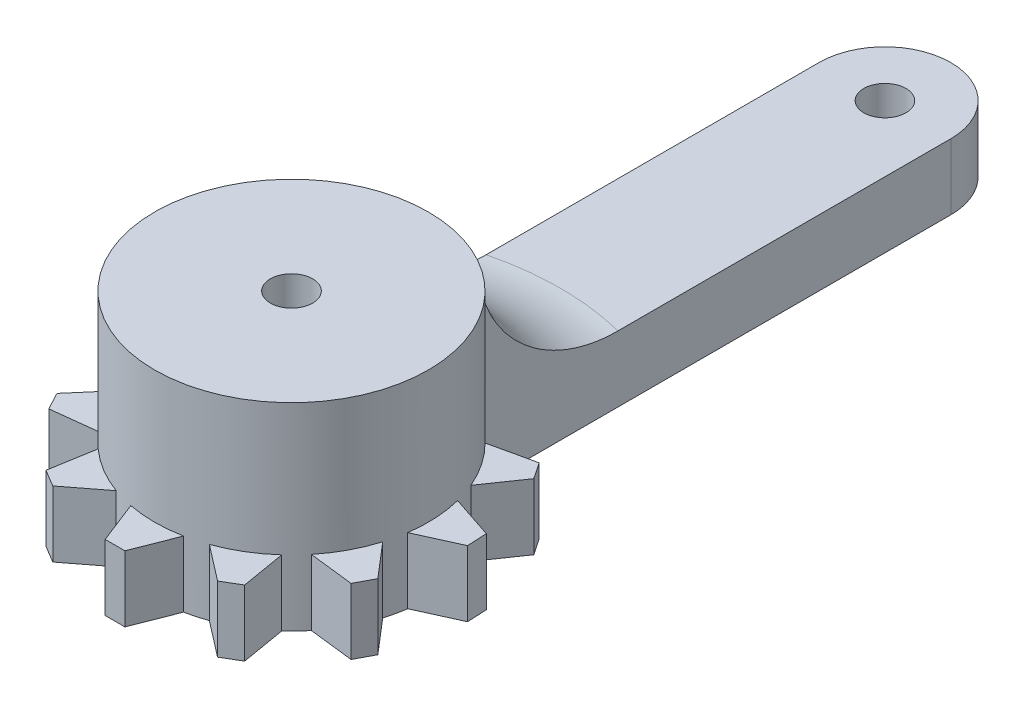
ISO-10303-21;
HEADER;
FILE_DESCRIPTION(('STEP AP214'),'2;1');
FILE_NAME('part.step','',(''),(''),'','','');
FILE_SCHEMA(('AUTOMOTIVE_DESIGN { 1 0 10303 214 1 1 1 1 }'));
ENDSEC;
DATA;
#1=APPLICATION_CONTEXT('core data for automotive mechanical design processes');
#2=APPLICATION_PROTOCOL_DEFINITION('international standard','automotive_design',2000,#1);
#3=PRODUCT_CONTEXT('',#1,'mechanical');
#4=PRODUCT('Part','Part','',(#3));
#5=PRODUCT_RELATED_PRODUCT_CATEGORY('part','',(#4));
#6=PRODUCT_DEFINITION_FORMATION('','',#4);
#7=PRODUCT_DEFINITION_CONTEXT('part definition',#1,'design');
#8=PRODUCT_DEFINITION('design','',#6,#7);
#9=PRODUCT_DEFINITION_SHAPE('','',#8);
#10=(LENGTH_UNIT() NAMED_UNIT(*) SI_UNIT(.MILLI.,.METRE.));
#11=(NAMED_UNIT(*) PLANE_ANGLE_UNIT() SI_UNIT($,.RADIAN.));
#12=(NAMED_UNIT(*) SI_UNIT($,.STERADIAN.) SOLID_ANGLE_UNIT());
#13=UNCERTAINTY_MEASURE_WITH_UNIT(LENGTH_MEASURE(1.E-05),#10,'distance_accuracy_value','');
#14=(GEOMETRIC_REPRESENTATION_CONTEXT(3) GLOBAL_UNCERTAINTY_ASSIGNED_CONTEXT((#13)) GLOBAL_UNIT_ASSIGNED_CONTEXT((#10,
#11,#12)) REPRESENTATION_CONTEXT('',''));
#15=CARTESIAN_POINT('',(0.,0.,0.));
#16=DIRECTION('',(0.,0.,1.));
#17=DIRECTION('',(1.,0.,0.));
#18=AXIS2_PLACEMENT_3D('',#15,#16,#17);
#19=CARTESIAN_POINT('',(0.,5.,0.));
#20=DIRECTION('',(0.,1.,0.));
#21=DIRECTION('',(0.,0.,1.));
#22=AXIS2_PLACEMENT_3D('',#19,#20,#21);
#23=PLANE('',#22);
#24=DIRECTION('',(0.791973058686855,0.,-0.610556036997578));
#25=VECTOR('',#24,1.);
#26=CARTESIAN_POINT('',(-6.24833396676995,5.,11.8551770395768));
#27=LINE('',#26,#25);
#28=CARTESIAN_POINT('',(-6.24833396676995,5.,11.8551770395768));
#29=VERTEX_POINT('',#28);
#30=CARTESIAN_POINT('',(-3.53158545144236,5.,9.76075325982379));
#31=VERTEX_POINT('',#30);
#32=EDGE_CURVE('E750',#29,#31,#27,.T.);
#33=ORIENTED_EDGE('',*,*,#32,.T.);
#34=CARTESIAN_POINT('',(0.,5.,0.));
#35=DIRECTION('',(0.,1.,0.));
#36=DIRECTION('',(0.,0.,1.));
#37=AXIS2_PLACEMENT_3D('',#34,#35,#36);
#38=CIRCLE('',#37,10.38);
#39=CARTESIAN_POINT('',(-6.9602546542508,5.,7.70060096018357));
#40=VERTEX_POINT('',#39);
#41=EDGE_CURVE('E329',#40,#31,#38,.T.);
#42=ORIENTED_EDGE('',*,*,#41,.F.);
#43=DIRECTION('',(-0.167280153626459,0.,0.985909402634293));
#44=VECTOR('',#43,1.);
#45=CARTESIAN_POINT('',(-7.53408491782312,5.,11.0826199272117));
#46=LINE('',#45,#44);
#47=CARTESIAN_POINT('',(-7.53408491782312,5.,11.0826199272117));
#48=VERTEX_POINT('',#47);
#49=EDGE_CURVE('E737',#40,#48,#46,.T.);
#50=ORIENTED_EDGE('',*,*,#49,.T.);
#51=DIRECTION('',(0.857167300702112,0.,0.515038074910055));
#52=VECTOR('',#51,1.);
#53=CARTESIAN_POINT('',(-7.53408491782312,5.,11.0826199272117));
#54=LINE('',#53,#52);
#55=EDGE_CURVE('E747',#48,#29,#54,.T.);
#56=ORIENTED_EDGE('',*,*,#55,.T.);
#57=EDGE_LOOP('',(#33,#42,#50,#56));
#58=FACE_BOUND('',#57,.T.);
#59=ADVANCED_FACE('F49',(#58),#23,.T.);
#60=DIRECTION('',(0.993313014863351,0.,-0.115452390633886));
#61=VECTOR('',#60,1.);
#62=CARTESIAN_POINT('',(-11.461735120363,5.,6.94374020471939));
#63=LINE('',#62,#61);
#64=CARTESIAN_POINT('',(-11.461735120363,5.,6.94374020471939));
#65=VERTEX_POINT('',#64);
#66=CARTESIAN_POINT('',(-8.05431913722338,5.,6.54769755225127));
#67=VERTEX_POINT('',#66);
#68=EDGE_CURVE('E724',#65,#67,#63,.T.);
#69=ORIENTED_EDGE('',*,*,#68,.T.);
#70=CARTESIAN_POINT('',(-9.93220538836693,5.,3.01590718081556));
#71=VERTEX_POINT('',#70);
#72=EDGE_CURVE('E790',#71,#67,#38,.T.);
#73=ORIENTED_EDGE('',*,*,#72,.F.);
#74=DIRECTION('',(-0.651167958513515,0.,0.758933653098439));
#75=VECTOR('',#74,1.);
#76=CARTESIAN_POINT('',(-12.1659424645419,5.,5.619318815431));
#77=LINE('',#76,#75);
#78=CARTESIAN_POINT('',(-12.1659424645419,5.,5.619318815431));
#79=VERTEX_POINT('',#78);
#80=EDGE_CURVE('E711',#71,#79,#77,.T.);
#81=ORIENTED_EDGE('',*,*,#80,.T.);
#82=DIRECTION('',(0.469471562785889,0.,0.882947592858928));
#83=VECTOR('',#82,1.);
#84=CARTESIAN_POINT('',(-12.1659424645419,5.,5.619318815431));
#85=LINE('',#84,#83);
#86=EDGE_CURVE('E721',#79,#65,#85,.T.);
#87=ORIENTED_EDGE('',*,*,#86,.T.);
#88=EDGE_LOOP('',(#69,#73,#81,#87));
#89=FACE_BOUND('',#88,.T.);
#90=ADVANCED_FACE('F429',(#89),#23,.T.);
#91=DIRECTION('',(0.910897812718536,0.,0.412632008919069));
#92=VECTOR('',#91,1.);
#93=CARTESIAN_POINT('',(-13.4009151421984,5.,0.0487170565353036));
#94=LINE('',#93,#92);
#95=CARTESIAN_POINT('',(-13.4009151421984,5.,0.0487170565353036));
#96=VERTEX_POINT('',#95);
#97=CARTESIAN_POINT('',(-10.2762125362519,5.,1.4641912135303));
#98=VERTEX_POINT('',#97);
#99=EDGE_CURVE('E698',#96,#98,#94,.T.);
#100=ORIENTED_EDGE('',*,*,#99,.T.);
#101=CARTESIAN_POINT('',(-10.0668687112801,5.,-2.53032692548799));
#102=VERTEX_POINT('',#101);
#103=EDGE_CURVE('E791',#102,#98,#38,.T.);
#104=ORIENTED_EDGE('',*,*,#103,.F.);
#105=DIRECTION('',(-0.94903960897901,0.,0.31515681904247));
#106=VECTOR('',#105,1.);
#107=CARTESIAN_POINT('',(-13.322411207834,5.,-1.44922724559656));
#108=LINE('',#107,#106);
#109=CARTESIAN_POINT('',(-13.322411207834,5.,-1.44922724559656));
#110=VERTEX_POINT('',#109);
#111=EDGE_CURVE('E685',#102,#110,#108,.T.);
#112=ORIENTED_EDGE('',*,*,#111,.T.);
#113=DIRECTION('',(-0.0523359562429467,0.,0.998629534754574));
#114=VECTOR('',#113,1.);
#115=CARTESIAN_POINT('',(-13.322411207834,5.,-1.44922724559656));
#116=LINE('',#115,#114);
#117=EDGE_CURVE('E695',#110,#96,#116,.T.);
#118=ORIENTED_EDGE('',*,*,#117,.T.);
#119=EDGE_LOOP('',(#100,#104,#112,#118));
#120=FACE_BOUND('',#119,.T.);
#121=ADVANCED_FACE('F826',(#120),#23,.T.);
#122=DIRECTION('',(0.568270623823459,0.,0.822841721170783));
#123=VECTOR('',#122,1.);
#124=CARTESIAN_POINT('',(-11.5119173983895,5.,-6.86022286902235));
#125=LINE('',#124,#123);
#126=CARTESIAN_POINT('',(-11.5119173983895,5.,-6.86022286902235));
#127=VERTEX_POINT('',#126);
#128=CARTESIAN_POINT('',(-9.56254758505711,5.,-4.03758389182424));
#129=VERTEX_POINT('',#128);
#130=EDGE_CURVE('E672',#127,#129,#125,.T.);
#131=ORIENTED_EDGE('',*,*,#130,.T.);
#132=CARTESIAN_POINT('',(-7.32577597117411,5.,-7.35373418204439));
#133=VERTEX_POINT('',#132);
#134=EDGE_CURVE('E792',#133,#129,#38,.T.);
#135=ORIENTED_EDGE('',*,*,#134,.F.);
#136=DIRECTION('',(-0.975803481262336,0.,-0.218649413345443));
#137=VECTOR('',#136,1.);
#138=CARTESIAN_POINT('',(-10.6731280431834,5.,-8.10377922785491));
#139=LINE('',#138,#137);
#140=CARTESIAN_POINT('',(-10.6731280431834,5.,-8.10377922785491));
#141=VERTEX_POINT('',#140);
#142=EDGE_CURVE('E659',#133,#141,#139,.T.);
#143=ORIENTED_EDGE('',*,*,#142,.T.);
#144=DIRECTION('',(-0.55919290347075,0.,0.82903757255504));
#145=VECTOR('',#144,1.);
#146=CARTESIAN_POINT('',(-10.6731280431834,5.,-8.10377922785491));
#147=LINE('',#146,#145);
#148=EDGE_CURVE('E669',#141,#127,#147,.T.);
#149=ORIENTED_EDGE('',*,*,#148,.T.);
#150=EDGE_LOOP('',(#131,#135,#143,#149));
#151=FACE_BOUND('',#150,.T.);
#152=ADVANCED_FACE('F814',(#151),#23,.T.);
#153=CARTESIAN_POINT('',(0.,5.,-45.));
#154=DIRECTION('',(0.,1.,0.));
#155=DIRECTION('',(0.,0.,1.));
#156=AXIS2_PLACEMENT_3D('',#153,#154,#155);
#157=CIRCLE('',#156,1.6);
#158=CARTESIAN_POINT('',(0.,5.,-43.4));
#159=VERTEX_POINT('',#158);
#160=EDGE_CURVE('E366',#159,#159,#157,.T.);
#161=ORIENTED_EDGE('',*,*,#160,.F.);
#162=EDGE_LOOP('',(#161));
#163=FACE_BOUND('',#162,.T.);
#164=DIRECTION('',(0.,0.,-1.));
#165=VECTOR('',#164,1.);
#166=CARTESIAN_POINT('',(-5.,5.,0.));
#167=LINE('',#166,#165);
#168=CARTESIAN_POINT('',(-5.,5.,-19.7571354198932));
#169=VERTEX_POINT('',#168);
#170=CARTESIAN_POINT('',(-5.,5.,-45.));
#171=VERTEX_POINT('',#170);
#172=EDGE_CURVE('E358',#169,#171,#167,.T.);
#173=ORIENTED_EDGE('',*,*,#172,.F.);
#174=CARTESIAN_POINT('',(0.,5.,0.));
#175=DIRECTION('',(0.,1.,0.));
#176=DIRECTION('',(0.,0.,1.));
#177=AXIS2_PLACEMENT_3D('',#174,#175,#176);
#178=CIRCLE('',#177,20.38);
#179=CARTESIAN_POINT('',(5.,5.,-19.7571354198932));
#180=VERTEX_POINT('',#179);
#181=EDGE_CURVE('E70',#169,#180,#178,.F.);
#182=ORIENTED_EDGE('',*,*,#181,.T.);
#183=DIRECTION('',(0.,0.,-1.));
#184=VECTOR('',#183,1.);
#185=CARTESIAN_POINT('',(5.,5.,0.));
#186=LINE('',#185,#184);
#187=CARTESIAN_POINT('',(5.,5.,-45.));
#188=VERTEX_POINT('',#187);
#189=EDGE_CURVE('E360',#180,#188,#186,.T.);
#190=ORIENTED_EDGE('',*,*,#189,.T.);
#191=CARTESIAN_POINT('',(0.,5.,-45.));
#192=DIRECTION('',(0.,1.,0.));
#193=DIRECTION('',(0.,0.,1.));
#194=AXIS2_PLACEMENT_3D('',#191,#192,#193);
#195=CIRCLE('',#194,5.);
#196=EDGE_CURVE('E363',#188,#171,#195,.T.);
#197=ORIENTED_EDGE('',*,*,#196,.T.);
#198=EDGE_LOOP('',(#173,#182,#190,#197));
#199=FACE_BOUND('',#198,.T.);
#200=ADVANCED_FACE('F803',(#163,#199),#23,.T.);
#201=DIRECTION('',(-0.975803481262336,0.,0.218649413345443));
#202=VECTOR('',#201,1.);
#203=CARTESIAN_POINT('',(10.6731280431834,5.,-8.10377922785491));
#204=LINE('',#203,#202);
#205=CARTESIAN_POINT('',(10.6731280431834,5.,-8.10377922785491));
#206=VERTEX_POINT('',#205);
#207=CARTESIAN_POINT('',(7.32577597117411,5.,-7.35373418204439));
#208=VERTEX_POINT('',#207);
#209=EDGE_CURVE('E568',#206,#208,#204,.T.);
#210=ORIENTED_EDGE('',*,*,#209,.T.);
#211=CARTESIAN_POINT('',(9.56254758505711,5.,-4.03758389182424));
#212=VERTEX_POINT('',#211);
#213=EDGE_CURVE('E793',#212,#208,#38,.T.);
#214=ORIENTED_EDGE('',*,*,#213,.F.);
#215=DIRECTION('',(0.568270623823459,0.,-0.822841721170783));
#216=VECTOR('',#215,1.);
#217=CARTESIAN_POINT('',(11.5119173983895,5.,-6.86022286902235));
#218=LINE('',#217,#216);
#219=CARTESIAN_POINT('',(11.5119173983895,5.,-6.86022286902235));
#220=VERTEX_POINT('',#219);
#221=EDGE_CURVE('E553',#212,#220,#218,.T.);
#222=ORIENTED_EDGE('',*,*,#221,.T.);
#223=DIRECTION('',(-0.55919290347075,0.,-0.82903757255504));
#224=VECTOR('',#223,1.);
#225=CARTESIAN_POINT('',(11.5119173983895,5.,-6.86022286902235));
#226=LINE('',#225,#224);
#227=EDGE_CURVE('E565',#220,#206,#226,.T.);
#228=ORIENTED_EDGE('',*,*,#227,.T.);
#229=EDGE_LOOP('',(#210,#214,#222,#228));
#230=FACE_BOUND('',#229,.T.);
#231=ADVANCED_FACE('F850',(#230),#23,.T.);
#232=DIRECTION('',(-0.94903960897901,0.,-0.31515681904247));
#233=VECTOR('',#232,1.);
#234=CARTESIAN_POINT('',(13.322411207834,5.,-1.44922724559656));
#235=LINE('',#234,#233);
#236=CARTESIAN_POINT('',(13.322411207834,5.,-1.44922724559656));
#237=VERTEX_POINT('',#236);
#238=CARTESIAN_POINT('',(10.0668687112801,5.,-2.53032692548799));
#239=VERTEX_POINT('',#238);
#240=EDGE_CURVE('E594',#237,#239,#235,.T.);
#241=ORIENTED_EDGE('',*,*,#240,.T.);
#242=CARTESIAN_POINT('',(10.2762125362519,5.,1.4641912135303));
#243=VERTEX_POINT('',#242);
#244=EDGE_CURVE('E794',#243,#239,#38,.T.);
#245=ORIENTED_EDGE('',*,*,#244,.F.);
#246=DIRECTION('',(0.910897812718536,0.,-0.412632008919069));
#247=VECTOR('',#246,1.);
#248=CARTESIAN_POINT('',(13.4009151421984,5.,0.0487170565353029));
#249=LINE('',#248,#247);
#250=CARTESIAN_POINT('',(13.4009151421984,5.,0.0487170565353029));
#251=VERTEX_POINT('',#250);
#252=EDGE_CURVE('E581',#243,#251,#249,.T.);
#253=ORIENTED_EDGE('',*,*,#252,.T.);
#254=DIRECTION('',(-0.0523359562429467,0.,-0.998629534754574));
#255=VECTOR('',#254,1.);
#256=CARTESIAN_POINT('',(13.4009151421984,5.,0.0487170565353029));
#257=LINE('',#256,#255);
#258=EDGE_CURVE('E591',#251,#237,#257,.T.);
#259=ORIENTED_EDGE('',*,*,#258,.T.);
#260=EDGE_LOOP('',(#241,#245,#253,#259));
#261=FACE_BOUND('',#260,.T.);
#262=ADVANCED_FACE('F854',(#261),#23,.T.);
#263=DIRECTION('',(-0.651167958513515,0.,-0.758933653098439));
#264=VECTOR('',#263,1.);
#265=CARTESIAN_POINT('',(12.1659424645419,5.,5.619318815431));
#266=LINE('',#265,#264);
#267=CARTESIAN_POINT('',(12.1659424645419,5.,5.619318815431));
#268=VERTEX_POINT('',#267);
#269=CARTESIAN_POINT('',(9.93220538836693,5.,3.01590718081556));
#270=VERTEX_POINT('',#269);
#271=EDGE_CURVE('E620',#268,#270,#266,.T.);
#272=ORIENTED_EDGE('',*,*,#271,.T.);
#273=CARTESIAN_POINT('',(8.05431913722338,5.,6.54769755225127));
#274=VERTEX_POINT('',#273);
#275=EDGE_CURVE('E796',#274,#270,#38,.T.);
#276=ORIENTED_EDGE('',*,*,#275,.F.);
#277=DIRECTION('',(0.993313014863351,0.,0.115452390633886));
#278=VECTOR('',#277,1.);
#279=CARTESIAN_POINT('',(11.461735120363,5.,6.94374020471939));
#280=LINE('',#279,#278);
#281=CARTESIAN_POINT('',(11.461735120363,5.,6.94374020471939));
#282=VERTEX_POINT('',#281);
#283=EDGE_CURVE('E607',#274,#282,#280,.T.);
#284=ORIENTED_EDGE('',*,*,#283,.T.);
#285=DIRECTION('',(0.469471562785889,0.,-0.882947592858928));
#286=VECTOR('',#285,1.);
#287=CARTESIAN_POINT('',(11.461735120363,5.,6.94374020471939));
#288=LINE('',#287,#286);
#289=EDGE_CURVE('E617',#282,#268,#288,.T.);
#290=ORIENTED_EDGE('',*,*,#289,.T.);
#291=EDGE_LOOP('',(#272,#276,#284,#290));
#292=FACE_BOUND('',#291,.T.);
#293=ADVANCED_FACE('F864',(#292),#23,.T.);
#294=DIRECTION('',(-0.167280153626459,0.,-0.985909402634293));
#295=VECTOR('',#294,1.);
#296=CARTESIAN_POINT('',(7.53408491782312,5.,11.0826199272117));
#297=LINE('',#296,#295);
#298=CARTESIAN_POINT('',(7.53408491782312,5.,11.0826199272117));
#299=VERTEX_POINT('',#298);
#300=CARTESIAN_POINT('',(6.9602546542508,5.,7.70060096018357));
#301=VERTEX_POINT('',#300);
#302=EDGE_CURVE('E646',#299,#301,#297,.T.);
#303=ORIENTED_EDGE('',*,*,#302,.T.);
#304=CARTESIAN_POINT('',(3.53158545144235,5.,9.76075325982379));
#305=VERTEX_POINT('',#304);
#306=EDGE_CURVE('E332',#305,#301,#38,.T.);
#307=ORIENTED_EDGE('',*,*,#306,.F.);
#308=DIRECTION('',(0.791973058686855,0.,0.610556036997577));
#309=VECTOR('',#308,1.);
#310=CARTESIAN_POINT('',(6.24833396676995,5.,11.8551770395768));
#311=LINE('',#310,#309);
#312=CARTESIAN_POINT('',(6.24833396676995,5.,11.8551770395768));
#313=VERTEX_POINT('',#312);
#314=EDGE_CURVE('E633',#305,#313,#311,.T.);
#315=ORIENTED_EDGE('',*,*,#314,.T.);
#316=DIRECTION('',(0.857167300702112,0.,-0.515038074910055));
#317=VECTOR('',#316,1.);
#318=CARTESIAN_POINT('',(6.24833396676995,5.,11.8551770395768));
#319=LINE('',#318,#317);
#320=EDGE_CURVE('E643',#313,#299,#319,.T.);
#321=ORIENTED_EDGE('',*,*,#320,.T.);
#322=EDGE_LOOP('',(#303,#307,#315,#321));
#323=FACE_BOUND('',#322,.T.);
#324=ADVANCED_FACE('F895',(#323),#23,.T.);
#325=DIRECTION('',(0.364393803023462,0.,-0.931244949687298));
#326=VECTOR('',#325,1.);
#327=CARTESIAN_POINT('',(0.75,5.,13.38));
#328=LINE('',#327,#326);
#329=CARTESIAN_POINT('',(0.75,5.,13.38));
#330=VERTEX_POINT('',#329);
#331=CARTESIAN_POINT('',(2.,5.,10.1854994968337));
#332=VERTEX_POINT('',#331);
#333=EDGE_CURVE('E337',#330,#332,#328,.T.);
#334=ORIENTED_EDGE('',*,*,#333,.T.);
#335=CARTESIAN_POINT('',(-2.,5.,10.1854994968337));
#336=VERTEX_POINT('',#335);
#337=EDGE_CURVE('E317',#336,#332,#38,.T.);
#338=ORIENTED_EDGE('',*,*,#337,.F.);
#339=DIRECTION('',(0.364393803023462,0.,0.931244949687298));
#340=VECTOR('',#339,1.);
#341=CARTESIAN_POINT('',(-0.75,5.,13.38));
#342=LINE('',#341,#340);
#343=CARTESIAN_POINT('',(-0.75,5.,13.38));
#344=VERTEX_POINT('',#343);
#345=EDGE_CURVE('E348',#336,#344,#342,.T.);
#346=ORIENTED_EDGE('',*,*,#345,.T.);
#347=DIRECTION('',(1.,0.,0.));
#348=VECTOR('',#347,1.);
#349=CARTESIAN_POINT('',(-0.75,5.,13.38));
#350=LINE('',#349,#348);
#351=EDGE_CURVE('E344',#344,#330,#350,.T.);
#352=ORIENTED_EDGE('',*,*,#351,.T.);
#353=EDGE_LOOP('',(#334,#338,#346,#352));
#354=FACE_BOUND('',#353,.T.);
#355=ADVANCED_FACE('F342',(#354),#23,.T.);
#356=CARTESIAN_POINT('',(-5.,5.,0.));
#357=DIRECTION('',(-1.,0.,0.));
#358=DIRECTION('',(0.,0.,1.));
#359=AXIS2_PLACEMENT_3D('',#356,#357,#358);
#360=PLANE('',#359);
#361=DIRECTION('',(0.,0.,-1.));
#362=VECTOR('',#361,1.);
#363=CARTESIAN_POINT('',(-5.,0.,0.));
#364=LINE('',#363,#362);
#365=CARTESIAN_POINT('',(-5.,0.,-9.09639489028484));
#366=VERTEX_POINT('',#365);
#367=CARTESIAN_POINT('',(-5.,0.,-45.));
#368=VERTEX_POINT('',#367);
#369=EDGE_CURVE('E356',#366,#368,#364,.T.);
#370=ORIENTED_EDGE('',*,*,#369,.F.);
#371=DIRECTION('',(0.,-1.,0.));
#372=VECTOR('',#371,1.);
#373=CARTESIAN_POINT('',(-5.,5.,-9.09639489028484));
#374=LINE('',#373,#372);
#375=CARTESIAN_POINT('',(-5.,15.,-9.09639489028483));
#376=VERTEX_POINT('',#375);
#377=EDGE_CURVE('E394',#376,#366,#374,.T.);
#378=ORIENTED_EDGE('',*,*,#377,.F.);
#379=CARTESIAN_POINT('',(-5.,15.,-9.09639489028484));
#380=CARTESIAN_POINT('',(-5.,14.8687480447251,-9.0963927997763));
#381=CARTESIAN_POINT('',(-5.,14.7375142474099,-9.09934433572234));
#382=CARTESIAN_POINT('',(-5.,14.4753156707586,-9.11112716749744));
#383=CARTESIAN_POINT('',(-5.,14.3443508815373,-9.11995824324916));
#384=CARTESIAN_POINT('',(-5.,13.9523959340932,-9.15521174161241));
#385=CARTESIAN_POINT('',(-5.,13.6921420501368,-9.19039452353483));
#386=CARTESIAN_POINT('',(-5.,13.1770833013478,-9.28325461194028));
#387=CARTESIAN_POINT('',(-5.,12.9222576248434,-9.34081797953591));
#388=CARTESIAN_POINT('',(-5.,12.4184350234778,-9.47749381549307));
#389=CARTESIAN_POINT('',(-5.,12.1694386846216,-9.55660844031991));
#390=CARTESIAN_POINT('',(-5.,11.6793566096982,-9.73504855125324));
#391=CARTESIAN_POINT('',(-5.,11.4382563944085,-9.8343343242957));
#392=CARTESIAN_POINT('',(-5.,10.9648609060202,-10.0519079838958));
#393=CARTESIAN_POINT('',(-5.,10.7325655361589,-10.1701956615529));
#394=CARTESIAN_POINT('',(-5.,10.0501269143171,-10.5519360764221));
#395=CARTESIAN_POINT('',(-5.,9.61469523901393,-10.8421683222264));
#396=CARTESIAN_POINT('',(-5.,8.76126564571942,-11.5074191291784));
#397=CARTESIAN_POINT('',(-5.,8.34691617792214,-11.8871091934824));
#398=CARTESIAN_POINT('',(-5.,7.77295154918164,-12.500523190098));
#399=CARTESIAN_POINT('',(-5.,7.58947115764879,-12.7124328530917));
#400=CARTESIAN_POINT('',(-5.,7.23921940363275,-13.1496146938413));
#401=CARTESIAN_POINT('',(-5.,7.07244357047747,-13.3748832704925));
#402=CARTESIAN_POINT('',(-5.,6.74227484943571,-13.858230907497));
#403=CARTESIAN_POINT('',(-5.,6.58053427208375,-14.1174389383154));
#404=CARTESIAN_POINT('',(-5.,6.27908064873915,-14.6482548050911));
#405=CARTESIAN_POINT('',(-5.,6.13936070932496,-14.9198587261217));
#406=CARTESIAN_POINT('',(-5.,5.88291290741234,-15.473679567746));
#407=CARTESIAN_POINT('',(-5.,5.76618287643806,-15.7558954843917));
#408=CARTESIAN_POINT('',(-5.,5.55663182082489,-16.3290378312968));
#409=CARTESIAN_POINT('',(-5.,5.463806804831,-16.6199627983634));
#410=CARTESIAN_POINT('',(-5.,5.32007287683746,-17.1455764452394));
#411=CARTESIAN_POINT('',(-5.,5.2644452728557,-17.3789870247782));
#412=CARTESIAN_POINT('',(-5.,5.16878359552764,-17.8489547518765));
#413=CARTESIAN_POINT('',(-5.,5.12874694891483,-18.0855113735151));
#414=CARTESIAN_POINT('',(-5.,5.06455161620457,-18.5606754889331));
#415=CARTESIAN_POINT('',(-5.,5.04038672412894,-18.799282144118));
#416=CARTESIAN_POINT('',(-5.,5.00810294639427,-19.2776339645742));
#417=CARTESIAN_POINT('',(-5.,4.99998786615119,-19.5173793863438));
#418=CARTESIAN_POINT('',(-5.,5.,-19.7571354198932));
#419=B_SPLINE_CURVE_WITH_KNOTS('',3,(#379,#380,#381,#382,#383,#384,#385,#386,#387,#388,#389,
#390,#391,#392,#393,#394,#395,#396,#397,#398,#399,#400,#401,#402,#403,#404,#405,#406,#407,#408,
#409,#410,#411,#412,#413,#414,#415,#416,#417,#418),.UNSPECIFIED.,.F.,.F.,(4,2,2,2,2,2,2,2,2,2,2,
2,2,2,2,2,2,2,2,4),(0.,0.393686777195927,0.787358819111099,1.57409567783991,2.35687864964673,
3.13973997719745,3.92107468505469,4.70240080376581,6.2658884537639,7.94457549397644,
8.78481888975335,9.62483680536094,10.5403798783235,11.4556357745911,12.3708052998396,
13.2858219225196,14.0051662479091,14.7243917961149,15.4433359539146,16.1624505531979),.UNSPECIFIED.);
#420=EDGE_CURVE('E63',#376,#169,#419,.T.);
#421=ORIENTED_EDGE('',*,*,#420,.T.);
#422=ORIENTED_EDGE('',*,*,#172,.T.);
#423=DIRECTION('',(0.,-1.,0.));
#424=VECTOR('',#423,1.);
#425=CARTESIAN_POINT('',(-5.,5.,-45.));
#426=LINE('',#425,#424);
#427=EDGE_CURVE('E369',#171,#368,#426,.T.);
#428=ORIENTED_EDGE('',*,*,#427,.T.);
#429=EDGE_LOOP('',(#370,#378,#421,#422,#428));
#430=FACE_BOUND('',#429,.T.);
#431=ADVANCED_FACE('F400',(#430),#360,.T.);
#432=CARTESIAN_POINT('',(0.,5.,0.));
#433=DIRECTION('',(0.,-1.,0.));
#434=DIRECTION('',(0.,0.,-1.));
#435=AXIS2_PLACEMENT_3D('',#432,#433,#434);
#436=CYLINDRICAL_SURFACE('',#435,10.38);
#437=CARTESIAN_POINT('',(0.,15.,0.));
#438=DIRECTION('',(0.,1.,0.));
#439=DIRECTION('',(0.,0.,1.));
#440=AXIS2_PLACEMENT_3D('',#437,#438,#439);
#441=CIRCLE('',#440,10.38);
#442=CARTESIAN_POINT('',(5.,15.,-9.09639489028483));
#443=VERTEX_POINT('',#442);
#444=EDGE_CURVE('E554',#376,#443,#441,.T.);
#445=ORIENTED_EDGE('',*,*,#444,.F.);
#446=ORIENTED_EDGE('',*,*,#377,.T.);
#447=CARTESIAN_POINT('',(0.,0.,0.));
#448=DIRECTION('',(0.,1.,0.));
#449=DIRECTION('',(0.,0.,1.));
#450=AXIS2_PLACEMENT_3D('',#447,#448,#449);
#451=CIRCLE('',#450,10.38);
#452=CARTESIAN_POINT('',(-7.32577597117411,0.,-7.35373418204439));
#453=VERTEX_POINT('',#452);
#454=EDGE_CURVE('E373',#366,#453,#451,.T.);
#455=ORIENTED_EDGE('',*,*,#454,.T.);
#456=DIRECTION('',(0.,1.,0.));
#457=VECTOR('',#456,1.);
#458=CARTESIAN_POINT('',(-7.3257759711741,-5.83589963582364,-7.35373418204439));
#459=LINE('',#458,#457);
#460=EDGE_CURVE('E663',#453,#133,#459,.T.);
#461=ORIENTED_EDGE('',*,*,#460,.T.);
#462=ORIENTED_EDGE('',*,*,#134,.T.);
#463=DIRECTION('',(0.,1.,0.));
#464=VECTOR('',#463,1.);
#465=CARTESIAN_POINT('',(-9.5625475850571,-5.83589963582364,-4.03758389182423));
#466=LINE('',#465,#464);
#467=CARTESIAN_POINT('',(-9.5625475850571,0.,-4.03758389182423));
#468=VERTEX_POINT('',#467);
#469=EDGE_CURVE('E678',#468,#129,#466,.T.);
#470=ORIENTED_EDGE('',*,*,#469,.F.);
#471=CARTESIAN_POINT('',(-10.0668687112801,0.,-2.53032692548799));
#472=VERTEX_POINT('',#471);
#473=EDGE_CURVE('E376',#468,#472,#451,.T.);
#474=ORIENTED_EDGE('',*,*,#473,.T.);
#475=DIRECTION('',(0.,1.,0.));
#476=VECTOR('',#475,1.);
#477=CARTESIAN_POINT('',(-10.0668687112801,-5.20307993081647,-2.53032692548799));
#478=LINE('',#477,#476);
#479=EDGE_CURVE('E689',#472,#102,#478,.T.);
#480=ORIENTED_EDGE('',*,*,#479,.T.);
#481=ORIENTED_EDGE('',*,*,#103,.T.);
#482=DIRECTION('',(0.,1.,0.));
#483=VECTOR('',#482,1.);
#484=CARTESIAN_POINT('',(-10.2762125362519,-5.20307993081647,1.4641912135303));
#485=LINE('',#484,#483);
#486=CARTESIAN_POINT('',(-10.2762125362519,0.,1.4641912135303));
#487=VERTEX_POINT('',#486);
#488=EDGE_CURVE('E704',#487,#98,#485,.T.);
#489=ORIENTED_EDGE('',*,*,#488,.F.);
#490=CARTESIAN_POINT('',(-9.93220538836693,0.,3.01590718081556));
#491=VERTEX_POINT('',#490);
#492=EDGE_CURVE('E777',#487,#491,#451,.T.);
#493=ORIENTED_EDGE('',*,*,#492,.T.);
#494=DIRECTION('',(0.,1.,0.));
#495=VECTOR('',#494,1.);
#496=CARTESIAN_POINT('',(-9.93220538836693,-5.68623941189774,3.01590718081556));
#497=LINE('',#496,#495);
#498=EDGE_CURVE('E715',#491,#71,#497,.T.);
#499=ORIENTED_EDGE('',*,*,#498,.T.);
#500=ORIENTED_EDGE('',*,*,#72,.T.);
#501=DIRECTION('',(0.,1.,0.));
#502=VECTOR('',#501,1.);
#503=CARTESIAN_POINT('',(-8.05431913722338,-5.68623941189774,6.54769755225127));
#504=LINE('',#503,#502);
#505=CARTESIAN_POINT('',(-8.05431913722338,0.,6.54769755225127));
#506=VERTEX_POINT('',#505);
#507=EDGE_CURVE('E730',#506,#67,#504,.T.);
#508=ORIENTED_EDGE('',*,*,#507,.F.);
#509=CARTESIAN_POINT('',(-6.96025465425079,0.,7.70060096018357));
#510=VERTEX_POINT('',#509);
#511=EDGE_CURVE('E773',#506,#510,#451,.T.);
#512=ORIENTED_EDGE('',*,*,#511,.T.);
#513=DIRECTION('',(0.,1.,0.));
#514=VECTOR('',#513,1.);
#515=CARTESIAN_POINT('',(-6.96025465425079,-5.76892575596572,7.70060096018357));
#516=LINE('',#515,#514);
#517=EDGE_CURVE('E741',#510,#40,#516,.T.);
#518=ORIENTED_EDGE('',*,*,#517,.T.);
#519=ORIENTED_EDGE('',*,*,#41,.T.);
#520=DIRECTION('',(0.,1.,0.));
#521=VECTOR('',#520,1.);
#522=CARTESIAN_POINT('',(-3.53158545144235,-5.76892575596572,9.76075325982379));
#523=LINE('',#522,#521);
#524=CARTESIAN_POINT('',(-3.53158545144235,0.,9.76075325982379));
#525=VERTEX_POINT('',#524);
#526=EDGE_CURVE('E756',#525,#31,#523,.T.);
#527=ORIENTED_EDGE('',*,*,#526,.F.);
#528=CARTESIAN_POINT('',(-2.,0.,10.1854994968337));
#529=VERTEX_POINT('',#528);
#530=EDGE_CURVE('E771',#525,#529,#451,.T.);
#531=ORIENTED_EDGE('',*,*,#530,.T.);
#532=DIRECTION('',(0.,1.,0.));
#533=VECTOR('',#532,1.);
#534=CARTESIAN_POINT('',(-2.,-5.11906568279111,10.1854994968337));
#535=LINE('',#534,#533);
#536=EDGE_CURVE('E324',#529,#336,#535,.T.);
#537=ORIENTED_EDGE('',*,*,#536,.T.);
#538=ORIENTED_EDGE('',*,*,#337,.T.);
#539=DIRECTION('',(0.,1.,0.));
#540=VECTOR('',#539,1.);
#541=CARTESIAN_POINT('',(2.,-5.11906568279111,10.1854994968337));
#542=LINE('',#541,#540);
#543=CARTESIAN_POINT('',(2.,0.,10.1854994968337));
#544=VERTEX_POINT('',#543);
#545=EDGE_CURVE('E321',#544,#332,#542,.T.);
#546=ORIENTED_EDGE('',*,*,#545,.F.);
#547=CARTESIAN_POINT('',(3.53158545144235,0.,9.76075325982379));
#548=VERTEX_POINT('',#547);
#549=EDGE_CURVE('E377',#544,#548,#451,.T.);
#550=ORIENTED_EDGE('',*,*,#549,.T.);
#551=DIRECTION('',(0.,1.,0.));
#552=VECTOR('',#551,1.);
#553=CARTESIAN_POINT('',(3.53158545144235,-5.76892575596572,9.76075325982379));
#554=LINE('',#553,#552);
#555=EDGE_CURVE('E637',#548,#305,#554,.T.);
#556=ORIENTED_EDGE('',*,*,#555,.T.);
#557=ORIENTED_EDGE('',*,*,#306,.T.);
#558=DIRECTION('',(0.,1.,0.));
#559=VECTOR('',#558,1.);
#560=CARTESIAN_POINT('',(6.9602546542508,-5.76892575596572,7.70060096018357));
#561=LINE('',#560,#559);
#562=CARTESIAN_POINT('',(6.9602546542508,0.,7.70060096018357));
#563=VERTEX_POINT('',#562);
#564=EDGE_CURVE('E652',#563,#301,#561,.T.);
#565=ORIENTED_EDGE('',*,*,#564,.F.);
#566=CARTESIAN_POINT('',(8.05431913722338,0.,6.54769755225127));
#567=VERTEX_POINT('',#566);
#568=EDGE_CURVE('E772',#563,#567,#451,.T.);
#569=ORIENTED_EDGE('',*,*,#568,.T.);
#570=DIRECTION('',(0.,1.,0.));
#571=VECTOR('',#570,1.);
#572=CARTESIAN_POINT('',(8.05431913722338,-5.68623941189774,6.54769755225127));
#573=LINE('',#572,#571);
#574=EDGE_CURVE('E611',#567,#274,#573,.T.);
#575=ORIENTED_EDGE('',*,*,#574,.T.);
#576=ORIENTED_EDGE('',*,*,#275,.T.);
#577=DIRECTION('',(0.,1.,0.));
#578=VECTOR('',#577,1.);
#579=CARTESIAN_POINT('',(9.93220538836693,-5.68623941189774,3.01590718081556));
#580=LINE('',#579,#578);
#581=CARTESIAN_POINT('',(9.93220538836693,0.,3.01590718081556));
#582=VERTEX_POINT('',#581);
#583=EDGE_CURVE('E626',#582,#270,#580,.T.);
#584=ORIENTED_EDGE('',*,*,#583,.F.);
#585=CARTESIAN_POINT('',(10.2762125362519,0.,1.4641912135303));
#586=VERTEX_POINT('',#585);
#587=EDGE_CURVE('E774',#582,#586,#451,.T.);
#588=ORIENTED_EDGE('',*,*,#587,.T.);
#589=DIRECTION('',(0.,1.,0.));
#590=VECTOR('',#589,1.);
#591=CARTESIAN_POINT('',(10.2762125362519,-5.20307993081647,1.4641912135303));
#592=LINE('',#591,#590);
#593=EDGE_CURVE('E585',#586,#243,#592,.T.);
#594=ORIENTED_EDGE('',*,*,#593,.T.);
#595=ORIENTED_EDGE('',*,*,#244,.T.);
#596=DIRECTION('',(0.,1.,0.));
#597=VECTOR('',#596,1.);
#598=CARTESIAN_POINT('',(10.0668687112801,-5.20307993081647,-2.53032692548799));
#599=LINE('',#598,#597);
#600=CARTESIAN_POINT('',(10.0668687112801,0.,-2.53032692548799));
#601=VERTEX_POINT('',#600);
#602=EDGE_CURVE('E600',#601,#239,#599,.T.);
#603=ORIENTED_EDGE('',*,*,#602,.F.);
#604=CARTESIAN_POINT('',(9.56254758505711,0.,-4.03758389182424));
#605=VERTEX_POINT('',#604);
#606=EDGE_CURVE('E776',#601,#605,#451,.T.);
#607=ORIENTED_EDGE('',*,*,#606,.T.);
#608=DIRECTION('',(0.,1.,0.));
#609=VECTOR('',#608,1.);
#610=CARTESIAN_POINT('',(9.5625475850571,-5.83589963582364,-4.03758389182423));
#611=LINE('',#610,#609);
#612=EDGE_CURVE('E559',#605,#212,#611,.T.);
#613=ORIENTED_EDGE('',*,*,#612,.T.);
#614=ORIENTED_EDGE('',*,*,#213,.T.);
#615=DIRECTION('',(0.,1.,0.));
#616=VECTOR('',#615,1.);
#617=CARTESIAN_POINT('',(7.3257759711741,-5.83589963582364,-7.35373418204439));
#618=LINE('',#617,#616);
#619=CARTESIAN_POINT('',(7.3257759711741,0.,-7.35373418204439));
#620=VERTEX_POINT('',#619);
#621=EDGE_CURVE('E574',#620,#208,#618,.T.);
#622=ORIENTED_EDGE('',*,*,#621,.F.);
#623=CARTESIAN_POINT('',(5.,0.,-9.09639489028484));
#624=VERTEX_POINT('',#623);
#625=EDGE_CURVE('E372',#620,#624,#451,.T.);
#626=ORIENTED_EDGE('',*,*,#625,.T.);
#627=DIRECTION('',(0.,-1.,0.));
#628=VECTOR('',#627,1.);
#629=CARTESIAN_POINT('',(5.,5.,-9.09639489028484));
#630=LINE('',#629,#628);
#631=EDGE_CURVE('E391',#443,#624,#630,.T.);
#632=ORIENTED_EDGE('',*,*,#631,.F.);
#633=EDGE_LOOP('',(#445,#446,#455,#461,#462,#470,#474,#480,#481,#489,#493,#499,#500,#508,#512,
#518,#519,#527,#531,#537,#538,#546,#550,#556,#557,#565,#569,#575,#576,#584,#588,#594,#595,#603,
#607,#613,#614,#622,#626,#632));
#634=FACE_BOUND('',#633,.T.);
#635=ADVANCED_FACE('F320',(#634),#436,.T.);
#636=CARTESIAN_POINT('',(5.,5.,0.));
#637=DIRECTION('',(-1.,0.,0.));
#638=DIRECTION('',(0.,0.,1.));
#639=AXIS2_PLACEMENT_3D('',#636,#637,#638);
#640=PLANE('',#639);
#641=DIRECTION('',(0.,0.,-1.));
#642=VECTOR('',#641,1.);
#643=CARTESIAN_POINT('',(5.,0.,0.));
#644=LINE('',#643,#642);
#645=CARTESIAN_POINT('',(5.,0.,-45.));
#646=VERTEX_POINT('',#645);
#647=EDGE_CURVE('E375',#624,#646,#644,.T.);
#648=ORIENTED_EDGE('',*,*,#647,.T.);
#649=DIRECTION('',(0.,-1.,0.));
#650=VECTOR('',#649,1.);
#651=CARTESIAN_POINT('',(5.,5.,-45.));
#652=LINE('',#651,#650);
#653=EDGE_CURVE('E388',#188,#646,#652,.T.);
#654=ORIENTED_EDGE('',*,*,#653,.F.);
#655=ORIENTED_EDGE('',*,*,#189,.F.);
#656=CARTESIAN_POINT('',(5.,5.,-19.7571354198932));
#657=CARTESIAN_POINT('',(5.,4.9999678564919,-19.4511182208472));
#658=CARTESIAN_POINT('',(5.,5.0131998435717,-19.1451269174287));
#659=CARTESIAN_POINT('',(5.,5.06572658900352,-18.5354485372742));
#660=CARTESIAN_POINT('',(5.,5.10501603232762,-18.2317610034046));
#661=CARTESIAN_POINT('',(5.,5.2091070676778,-17.6293108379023));
#662=CARTESIAN_POINT('',(5.,5.27386667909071,-17.330540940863));
#663=CARTESIAN_POINT('',(5.,5.42823326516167,-16.7394902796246));
#664=CARTESIAN_POINT('',(5.,5.51784104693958,-16.4472097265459));
#665=CARTESIAN_POINT('',(5.,5.72108039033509,-15.8712585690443));
#666=CARTESIAN_POINT('',(5.,5.83470098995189,-15.5875841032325));
#667=CARTESIAN_POINT('',(5.,6.08507671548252,-15.0305896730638));
#668=CARTESIAN_POINT('',(5.,6.2218405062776,-14.7572736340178));
#669=CARTESIAN_POINT('',(5.,6.66537157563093,-13.9557448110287));
#670=CARTESIAN_POINT('',(5.,7.0055215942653,-13.4455480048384));
#671=CARTESIAN_POINT('',(5.,7.77205380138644,-12.480539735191));
#672=CARTESIAN_POINT('',(5.,8.19976717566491,-12.0267819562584));
#673=CARTESIAN_POINT('',(5.,8.89494266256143,-11.4067417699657));
#674=CARTESIAN_POINT('',(5.,9.13581619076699,-11.2100281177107));
#675=CARTESIAN_POINT('',(5.,9.63404402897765,-10.8388090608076));
#676=CARTESIAN_POINT('',(5.,9.89139003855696,-10.6642926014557));
#677=CARTESIAN_POINT('',(5.,10.4133998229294,-10.3441831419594));
#678=CARTESIAN_POINT('',(5.,10.6776442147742,-10.1979060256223));
#679=CARTESIAN_POINT('',(5.,11.2185271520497,-9.93023169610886));
#680=CARTESIAN_POINT('',(5.,11.4951670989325,-9.80883730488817));
#681=CARTESIAN_POINT('',(5.,12.0580932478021,-9.59321839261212));
#682=CARTESIAN_POINT('',(5.,12.3443542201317,-9.49892818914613));
#683=CARTESIAN_POINT('',(5.,12.9246181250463,-9.33899609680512));
#684=CARTESIAN_POINT('',(5.,13.218616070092,-9.27333620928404));
#685=CARTESIAN_POINT('',(5.,13.7603710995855,-9.18080714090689));
#686=CARTESIAN_POINT('',(5.,14.0073195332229,-9.14918962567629));
#687=CARTESIAN_POINT('',(5.,14.3789657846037,-9.11753465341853));
#688=CARTESIAN_POINT('',(5.,14.5030296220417,-9.10961155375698));
#689=CARTESIAN_POINT('',(5.,14.7513911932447,-9.09904039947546));
#690=CARTESIAN_POINT('',(5.,14.8756889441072,-9.09639274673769));
#691=CARTESIAN_POINT('',(5.,15.,-9.09639489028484));
#692=B_SPLINE_CURVE_WITH_KNOTS('',3,(#656,#657,#658,#659,#660,#661,#662,#663,#664,#665,#666,
#667,#668,#669,#670,#671,#672,#673,#674,#675,#676,#677,#678,#679,#680,#681,#682,#683,#684,#685,
#686,#687,#688,#689,#690,#691),.UNSPECIFIED.,.F.,.F.,(4,2,2,2,2,2,2,2,2,2,2,2,2,2,2,2,2,4),(0.,
0.917727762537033,1.83526839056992,2.75130299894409,3.66736736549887,4.58301444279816,
5.49900510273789,7.32971844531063,9.19066201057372,10.1226255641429,11.0541231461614,
11.9589969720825,12.8639733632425,13.7667378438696,14.6689339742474,15.4148998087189,
15.7877500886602,16.1606287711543),.UNSPECIFIED.);
#693=EDGE_CURVE('E11',#180,#443,#692,.T.);
#694=ORIENTED_EDGE('',*,*,#693,.T.);
#695=ORIENTED_EDGE('',*,*,#631,.T.);
#696=EDGE_LOOP('',(#648,#654,#655,#694,#695));
#697=FACE_BOUND('',#696,.T.);
#698=ADVANCED_FACE('F405',(#697),#640,.F.);
#699=CARTESIAN_POINT('',(0.,5.,-45.));
#700=DIRECTION('',(0.,-1.,0.));
#701=DIRECTION('',(0.,0.,-1.));
#702=AXIS2_PLACEMENT_3D('',#699,#700,#701);
#703=CYLINDRICAL_SURFACE('',#702,1.6);
#704=ORIENTED_EDGE('',*,*,#160,.T.);
#705=EDGE_LOOP('',(#704));
#706=FACE_BOUND('',#705,.T.);
#707=CARTESIAN_POINT('',(0.,0.,-45.));
#708=DIRECTION('',(0.,1.,0.));
#709=DIRECTION('',(0.,0.,1.));
#710=AXIS2_PLACEMENT_3D('',#707,#708,#709);
#711=CIRCLE('',#710,1.6);
#712=CARTESIAN_POINT('',(0.,0.,-43.4));
#713=VERTEX_POINT('',#712);
#714=EDGE_CURVE('E382',#713,#713,#711,.T.);
#715=ORIENTED_EDGE('',*,*,#714,.F.);
#716=EDGE_LOOP('',(#715));
#717=FACE_BOUND('',#716,.T.);
#718=ADVANCED_FACE('F409',(#706,#717),#703,.F.);
#719=CARTESIAN_POINT('',(0.,5.,-45.));
#720=DIRECTION('',(0.,-1.,0.));
#721=DIRECTION('',(0.,0.,-1.));
#722=AXIS2_PLACEMENT_3D('',#719,#720,#721);
#723=CYLINDRICAL_SURFACE('',#722,5.);
#724=CARTESIAN_POINT('',(0.,0.,-45.));
#725=DIRECTION('',(0.,1.,0.));
#726=DIRECTION('',(0.,0.,1.));
#727=AXIS2_PLACEMENT_3D('',#724,#725,#726);
#728=CIRCLE('',#727,5.);
#729=EDGE_CURVE('E379',#646,#368,#728,.T.);
#730=ORIENTED_EDGE('',*,*,#729,.T.);
#731=ORIENTED_EDGE('',*,*,#427,.F.);
#732=ORIENTED_EDGE('',*,*,#196,.F.);
#733=ORIENTED_EDGE('',*,*,#653,.T.);
#734=EDGE_LOOP('',(#730,#731,#732,#733));
#735=FACE_BOUND('',#734,.T.);
#736=ADVANCED_FACE('F411',(#735),#723,.T.);
#737=CARTESIAN_POINT('',(0.,5.,0.));
#738=DIRECTION('',(0.,-1.,0.));
#739=DIRECTION('',(0.,0.,-1.));
#740=AXIS2_PLACEMENT_3D('',#737,#738,#739);
#741=CYLINDRICAL_SURFACE('',#740,1.6);
#742=CARTESIAN_POINT('',(0.,0.,0.));
#743=DIRECTION('',(0.,1.,0.));
#744=DIRECTION('',(0.,0.,1.));
#745=AXIS2_PLACEMENT_3D('',#742,#743,#744);
#746=CIRCLE('',#745,1.6);
#747=CARTESIAN_POINT('',(0.,0.,1.6));
#748=VERTEX_POINT('',#747);
#749=EDGE_CURVE('E361',#748,#748,#746,.T.);
#750=ORIENTED_EDGE('',*,*,#749,.F.);
#751=EDGE_LOOP('',(#750));
#752=FACE_BOUND('',#751,.T.);
#753=CARTESIAN_POINT('',(0.,15.,0.));
#754=DIRECTION('',(0.,1.,0.));
#755=DIRECTION('',(0.,0.,1.));
#756=AXIS2_PLACEMENT_3D('',#753,#754,#755);
#757=CIRCLE('',#756,1.6);
#758=CARTESIAN_POINT('',(0.,15.,1.6));
#759=VERTEX_POINT('',#758);
#760=EDGE_CURVE('E330',#759,#759,#757,.T.);
#761=ORIENTED_EDGE('',*,*,#760,.T.);
#762=EDGE_LOOP('',(#761));
#763=FACE_BOUND('',#762,.T.);
#764=ADVANCED_FACE('F414',(#752,#763),#741,.F.);
#765=CARTESIAN_POINT('',(0.,0.,0.));
#766=DIRECTION('',(0.,1.,0.));
#767=DIRECTION('',(0.,0.,1.));
#768=AXIS2_PLACEMENT_3D('',#765,#766,#767);
#769=PLANE('',#768);
#770=ORIENTED_EDGE('',*,*,#369,.T.);
#771=ORIENTED_EDGE('',*,*,#729,.F.);
#772=ORIENTED_EDGE('',*,*,#647,.F.);
#773=ORIENTED_EDGE('',*,*,#625,.F.);
#774=DIRECTION('',(0.975803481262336,0.,-0.218649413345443));
#775=VECTOR('',#774,1.);
#776=CARTESIAN_POINT('',(10.6731280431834,0.,-8.10377922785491));
#777=LINE('',#776,#775);
#778=CARTESIAN_POINT('',(10.6731280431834,0.,-8.10377922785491));
#779=VERTEX_POINT('',#778);
#780=EDGE_CURVE('E556',#620,#779,#777,.T.);
#781=ORIENTED_EDGE('',*,*,#780,.T.);
#782=DIRECTION('',(0.55919290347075,0.,0.82903757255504));
#783=VECTOR('',#782,1.);
#784=CARTESIAN_POINT('',(11.5119173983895,0.,-6.86022286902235));
#785=LINE('',#784,#783);
#786=CARTESIAN_POINT('',(11.5119173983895,0.,-6.86022286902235));
#787=VERTEX_POINT('',#786);
#788=EDGE_CURVE('E562',#779,#787,#785,.T.);
#789=ORIENTED_EDGE('',*,*,#788,.T.);
#790=DIRECTION('',(-0.568270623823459,0.,0.822841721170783));
#791=VECTOR('',#790,1.);
#792=CARTESIAN_POINT('',(11.5119173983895,0.,-6.86022286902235));
#793=LINE('',#792,#791);
#794=EDGE_CURVE('E558',#787,#605,#793,.T.);
#795=ORIENTED_EDGE('',*,*,#794,.T.);
#796=ORIENTED_EDGE('',*,*,#606,.F.);
#797=DIRECTION('',(0.94903960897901,0.,0.31515681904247));
#798=VECTOR('',#797,1.);
#799=CARTESIAN_POINT('',(13.322411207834,0.,-1.44922724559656));
#800=LINE('',#799,#798);
#801=CARTESIAN_POINT('',(13.322411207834,0.,-1.44922724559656));
#802=VERTEX_POINT('',#801);
#803=EDGE_CURVE('E582',#601,#802,#800,.T.);
#804=ORIENTED_EDGE('',*,*,#803,.T.);
#805=DIRECTION('',(0.0523359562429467,0.,0.998629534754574));
#806=VECTOR('',#805,1.);
#807=CARTESIAN_POINT('',(13.4009151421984,0.,0.0487170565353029));
#808=LINE('',#807,#806);
#809=CARTESIAN_POINT('',(13.4009151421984,0.,0.0487170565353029));
#810=VERTEX_POINT('',#809);
#811=EDGE_CURVE('E588',#802,#810,#808,.T.);
#812=ORIENTED_EDGE('',*,*,#811,.T.);
#813=DIRECTION('',(-0.910897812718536,0.,0.412632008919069));
#814=VECTOR('',#813,1.);
#815=CARTESIAN_POINT('',(13.4009151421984,0.,0.0487170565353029));
#816=LINE('',#815,#814);
#817=EDGE_CURVE('E584',#810,#586,#816,.T.);
#818=ORIENTED_EDGE('',*,*,#817,.T.);
#819=ORIENTED_EDGE('',*,*,#587,.F.);
#820=DIRECTION('',(0.651167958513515,0.,0.758933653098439));
#821=VECTOR('',#820,1.);
#822=CARTESIAN_POINT('',(12.1659424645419,0.,5.619318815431));
#823=LINE('',#822,#821);
#824=CARTESIAN_POINT('',(12.1659424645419,0.,5.619318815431));
#825=VERTEX_POINT('',#824);
#826=EDGE_CURVE('E608',#582,#825,#823,.T.);
#827=ORIENTED_EDGE('',*,*,#826,.T.);
#828=DIRECTION('',(-0.469471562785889,0.,0.882947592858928));
#829=VECTOR('',#828,1.);
#830=CARTESIAN_POINT('',(11.461735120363,0.,6.94374020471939));
#831=LINE('',#830,#829);
#832=CARTESIAN_POINT('',(11.461735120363,0.,6.94374020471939));
#833=VERTEX_POINT('',#832);
#834=EDGE_CURVE('E614',#825,#833,#831,.T.);
#835=ORIENTED_EDGE('',*,*,#834,.T.);
#836=DIRECTION('',(-0.993313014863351,0.,-0.115452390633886));
#837=VECTOR('',#836,1.);
#838=CARTESIAN_POINT('',(11.461735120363,0.,6.94374020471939));
#839=LINE('',#838,#837);
#840=EDGE_CURVE('E610',#833,#567,#839,.T.);
#841=ORIENTED_EDGE('',*,*,#840,.T.);
#842=ORIENTED_EDGE('',*,*,#568,.F.);
#843=DIRECTION('',(0.167280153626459,0.,0.985909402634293));
#844=VECTOR('',#843,1.);
#845=CARTESIAN_POINT('',(7.53408491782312,0.,11.0826199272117));
#846=LINE('',#845,#844);
#847=CARTESIAN_POINT('',(7.53408491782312,0.,11.0826199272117));
#848=VERTEX_POINT('',#847);
#849=EDGE_CURVE('E634',#563,#848,#846,.T.);
#850=ORIENTED_EDGE('',*,*,#849,.T.);
#851=DIRECTION('',(-0.857167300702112,0.,0.515038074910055));
#852=VECTOR('',#851,1.);
#853=CARTESIAN_POINT('',(6.24833396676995,0.,11.8551770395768));
#854=LINE('',#853,#852);
#855=CARTESIAN_POINT('',(6.24833396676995,0.,11.8551770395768));
#856=VERTEX_POINT('',#855);
#857=EDGE_CURVE('E640',#848,#856,#854,.T.);
#858=ORIENTED_EDGE('',*,*,#857,.T.);
#859=DIRECTION('',(-0.791973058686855,0.,-0.610556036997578));
#860=VECTOR('',#859,1.);
#861=CARTESIAN_POINT('',(6.24833396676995,0.,11.8551770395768));
#862=LINE('',#861,#860);
#863=EDGE_CURVE('E636',#856,#548,#862,.T.);
#864=ORIENTED_EDGE('',*,*,#863,.T.);
#865=ORIENTED_EDGE('',*,*,#549,.F.);
#866=DIRECTION('',(-0.364393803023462,0.,0.931244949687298));
#867=VECTOR('',#866,1.);
#868=CARTESIAN_POINT('',(0.75,0.,13.38));
#869=LINE('',#868,#867);
#870=CARTESIAN_POINT('',(0.75,0.,13.38));
#871=VERTEX_POINT('',#870);
#872=EDGE_CURVE('E339',#544,#871,#869,.T.);
#873=ORIENTED_EDGE('',*,*,#872,.T.);
#874=DIRECTION('',(-1.,0.,0.));
#875=VECTOR('',#874,1.);
#876=CARTESIAN_POINT('',(-0.75,0.,13.38));
#877=LINE('',#876,#875);
#878=CARTESIAN_POINT('',(-0.75,0.,13.38));
#879=VERTEX_POINT('',#878);
#880=EDGE_CURVE('E354',#871,#879,#877,.T.);
#881=ORIENTED_EDGE('',*,*,#880,.T.);
#882=DIRECTION('',(-0.364393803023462,0.,-0.931244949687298));
#883=VECTOR('',#882,1.);
#884=CARTESIAN_POINT('',(-0.75,0.,13.38));
#885=LINE('',#884,#883);
#886=EDGE_CURVE('E357',#879,#529,#885,.T.);
#887=ORIENTED_EDGE('',*,*,#886,.T.);
#888=ORIENTED_EDGE('',*,*,#530,.F.);
#889=DIRECTION('',(-0.791973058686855,0.,0.610556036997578));
#890=VECTOR('',#889,1.);
#891=CARTESIAN_POINT('',(-6.24833396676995,0.,11.8551770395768));
#892=LINE('',#891,#890);
#893=CARTESIAN_POINT('',(-6.24833396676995,0.,11.8551770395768));
#894=VERTEX_POINT('',#893);
#895=EDGE_CURVE('E738',#525,#894,#892,.T.);
#896=ORIENTED_EDGE('',*,*,#895,.T.);
#897=DIRECTION('',(-0.857167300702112,0.,-0.515038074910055));
#898=VECTOR('',#897,1.);
#899=CARTESIAN_POINT('',(-7.53408491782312,0.,11.0826199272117));
#900=LINE('',#899,#898);
#901=CARTESIAN_POINT('',(-7.53408491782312,0.,11.0826199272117));
#902=VERTEX_POINT('',#901);
#903=EDGE_CURVE('E744',#894,#902,#900,.T.);
#904=ORIENTED_EDGE('',*,*,#903,.T.);
#905=DIRECTION('',(0.167280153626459,0.,-0.985909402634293));
#906=VECTOR('',#905,1.);
#907=CARTESIAN_POINT('',(-7.53408491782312,0.,11.0826199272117));
#908=LINE('',#907,#906);
#909=EDGE_CURVE('E740',#902,#510,#908,.T.);
#910=ORIENTED_EDGE('',*,*,#909,.T.);
#911=ORIENTED_EDGE('',*,*,#511,.F.);
#912=DIRECTION('',(-0.993313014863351,0.,0.115452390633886));
#913=VECTOR('',#912,1.);
#914=CARTESIAN_POINT('',(-11.461735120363,0.,6.94374020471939));
#915=LINE('',#914,#913);
#916=CARTESIAN_POINT('',(-11.461735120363,0.,6.94374020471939));
#917=VERTEX_POINT('',#916);
#918=EDGE_CURVE('E712',#506,#917,#915,.T.);
#919=ORIENTED_EDGE('',*,*,#918,.T.);
#920=DIRECTION('',(-0.469471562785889,0.,-0.882947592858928));
#921=VECTOR('',#920,1.);
#922=CARTESIAN_POINT('',(-12.1659424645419,0.,5.619318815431));
#923=LINE('',#922,#921);
#924=CARTESIAN_POINT('',(-12.1659424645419,0.,5.619318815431));
#925=VERTEX_POINT('',#924);
#926=EDGE_CURVE('E718',#917,#925,#923,.T.);
#927=ORIENTED_EDGE('',*,*,#926,.T.);
#928=DIRECTION('',(0.651167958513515,0.,-0.758933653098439));
#929=VECTOR('',#928,1.);
#930=CARTESIAN_POINT('',(-12.1659424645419,0.,5.619318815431));
#931=LINE('',#930,#929);
#932=EDGE_CURVE('E714',#925,#491,#931,.T.);
#933=ORIENTED_EDGE('',*,*,#932,.T.);
#934=ORIENTED_EDGE('',*,*,#492,.F.);
#935=DIRECTION('',(-0.910897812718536,0.,-0.412632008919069));
#936=VECTOR('',#935,1.);
#937=CARTESIAN_POINT('',(-13.4009151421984,0.,0.0487170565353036));
#938=LINE('',#937,#936);
#939=CARTESIAN_POINT('',(-13.4009151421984,0.,0.0487170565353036));
#940=VERTEX_POINT('',#939);
#941=EDGE_CURVE('E686',#487,#940,#938,.T.);
#942=ORIENTED_EDGE('',*,*,#941,.T.);
#943=DIRECTION('',(0.0523359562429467,0.,-0.998629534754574));
#944=VECTOR('',#943,1.);
#945=CARTESIAN_POINT('',(-13.322411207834,0.,-1.44922724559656));
#946=LINE('',#945,#944);
#947=CARTESIAN_POINT('',(-13.322411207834,0.,-1.44922724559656));
#948=VERTEX_POINT('',#947);
#949=EDGE_CURVE('E692',#940,#948,#946,.T.);
#950=ORIENTED_EDGE('',*,*,#949,.T.);
#951=DIRECTION('',(0.94903960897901,0.,-0.31515681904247));
#952=VECTOR('',#951,1.);
#953=CARTESIAN_POINT('',(-13.322411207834,0.,-1.44922724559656));
#954=LINE('',#953,#952);
#955=EDGE_CURVE('E688',#948,#472,#954,.T.);
#956=ORIENTED_EDGE('',*,*,#955,.T.);
#957=ORIENTED_EDGE('',*,*,#473,.F.);
#958=DIRECTION('',(-0.568270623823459,0.,-0.822841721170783));
#959=VECTOR('',#958,1.);
#960=CARTESIAN_POINT('',(-11.5119173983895,0.,-6.86022286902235));
#961=LINE('',#960,#959);
#962=CARTESIAN_POINT('',(-11.5119173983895,0.,-6.86022286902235));
#963=VERTEX_POINT('',#962);
#964=EDGE_CURVE('E660',#468,#963,#961,.T.);
#965=ORIENTED_EDGE('',*,*,#964,.T.);
#966=DIRECTION('',(0.55919290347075,0.,-0.82903757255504));
#967=VECTOR('',#966,1.);
#968=CARTESIAN_POINT('',(-10.6731280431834,0.,-8.10377922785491));
#969=LINE('',#968,#967);
#970=CARTESIAN_POINT('',(-10.6731280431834,0.,-8.10377922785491));
#971=VERTEX_POINT('',#970);
#972=EDGE_CURVE('E666',#963,#971,#969,.T.);
#973=ORIENTED_EDGE('',*,*,#972,.T.);
#974=DIRECTION('',(0.975803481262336,0.,0.218649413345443));
#975=VECTOR('',#974,1.);
#976=CARTESIAN_POINT('',(-10.6731280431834,0.,-8.10377922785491));
#977=LINE('',#976,#975);
#978=EDGE_CURVE('E662',#971,#453,#977,.T.);
#979=ORIENTED_EDGE('',*,*,#978,.T.);
#980=ORIENTED_EDGE('',*,*,#454,.F.);
#981=EDGE_LOOP('',(#770,#771,#772,#773,#781,#789,#795,#796,#804,#812,#818,#819,#827,#835,#841,
#842,#850,#858,#864,#865,#873,#881,#887,#888,#896,#904,#910,#911,#919,#927,#933,#934,#942,#950,
#956,#957,#965,#973,#979,#980));
#982=FACE_BOUND('',#981,.T.);
#983=ORIENTED_EDGE('',*,*,#714,.T.);
#984=EDGE_LOOP('',(#983));
#985=FACE_BOUND('',#984,.T.);
#986=ORIENTED_EDGE('',*,*,#749,.T.);
#987=EDGE_LOOP('',(#986));
#988=FACE_BOUND('',#987,.T.);
#989=ADVANCED_FACE('F421',(#982,#985,#988),#769,.F.);
#990=CARTESIAN_POINT('',(-0.75,-5.11906568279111,13.38));
#991=DIRECTION('',(-0.931244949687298,0.,0.364393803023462));
#992=DIRECTION('',(0.364393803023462,0.,0.931244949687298));
#993=AXIS2_PLACEMENT_3D('',#990,#991,#992);
#994=PLANE('',#993);
#995=ORIENTED_EDGE('',*,*,#886,.F.);
#996=DIRECTION('',(0.,1.,0.));
#997=VECTOR('',#996,1.);
#998=CARTESIAN_POINT('',(-0.75,-5.11906568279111,13.38));
#999=LINE('',#998,#997);
#1000=EDGE_CURVE('E345',#879,#344,#999,.T.);
#1001=ORIENTED_EDGE('',*,*,#1000,.T.);
#1002=ORIENTED_EDGE('',*,*,#345,.F.);
#1003=ORIENTED_EDGE('',*,*,#536,.F.);
#1004=EDGE_LOOP('',(#995,#1001,#1002,#1003));
#1005=FACE_BOUND('',#1004,.T.);
#1006=ADVANCED_FACE('F425',(#1005),#994,.T.);
#1007=CARTESIAN_POINT('',(0.75,-5.11906568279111,13.38));
#1008=DIRECTION('',(0.931244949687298,0.,0.364393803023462));
#1009=DIRECTION('',(0.364393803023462,0.,-0.931244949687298));
#1010=AXIS2_PLACEMENT_3D('',#1007,#1008,#1009);
#1011=PLANE('',#1010);
#1012=ORIENTED_EDGE('',*,*,#872,.F.);
#1013=ORIENTED_EDGE('',*,*,#545,.T.);
#1014=ORIENTED_EDGE('',*,*,#333,.F.);
#1015=DIRECTION('',(0.,1.,0.));
#1016=VECTOR('',#1015,1.);
#1017=CARTESIAN_POINT('',(0.75,-5.11906568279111,13.38));
#1018=LINE('',#1017,#1016);
#1019=EDGE_CURVE('E340',#871,#330,#1018,.T.);
#1020=ORIENTED_EDGE('',*,*,#1019,.F.);
#1021=EDGE_LOOP('',(#1012,#1013,#1014,#1020));
#1022=FACE_BOUND('',#1021,.T.);
#1023=ADVANCED_FACE('F335',(#1022),#1011,.T.);
#1024=CARTESIAN_POINT('',(-0.75,-5.11906568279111,13.38));
#1025=DIRECTION('',(0.,0.,1.));
#1026=DIRECTION('',(1.,0.,0.));
#1027=AXIS2_PLACEMENT_3D('',#1024,#1025,#1026);
#1028=PLANE('',#1027);
#1029=ORIENTED_EDGE('',*,*,#880,.F.);
#1030=ORIENTED_EDGE('',*,*,#1019,.T.);
#1031=ORIENTED_EDGE('',*,*,#351,.F.);
#1032=ORIENTED_EDGE('',*,*,#1000,.F.);
#1033=EDGE_LOOP('',(#1029,#1030,#1031,#1032));
#1034=FACE_BOUND('',#1033,.T.);
#1035=ADVANCED_FACE('F434',(#1034),#1028,.T.);
#1036=CARTESIAN_POINT('',(-7.53408491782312,-5.76892575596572,11.0826199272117));
#1037=DIRECTION('',(-0.985909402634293,0.,-0.167280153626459));
#1038=DIRECTION('',(-0.167280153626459,0.,0.985909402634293));
#1039=AXIS2_PLACEMENT_3D('',#1036,#1037,#1038);
#1040=PLANE('',#1039);
#1041=ORIENTED_EDGE('',*,*,#909,.F.);
#1042=DIRECTION('',(0.,1.,0.));
#1043=VECTOR('',#1042,1.);
#1044=CARTESIAN_POINT('',(-7.53408491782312,-5.76892575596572,11.0826199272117));
#1045=LINE('',#1044,#1043);
#1046=EDGE_CURVE('E753',#902,#48,#1045,.T.);
#1047=ORIENTED_EDGE('',*,*,#1046,.T.);
#1048=ORIENTED_EDGE('',*,*,#49,.F.);
#1049=ORIENTED_EDGE('',*,*,#517,.F.);
#1050=EDGE_LOOP('',(#1041,#1047,#1048,#1049));
#1051=FACE_BOUND('',#1050,.T.);
#1052=ADVANCED_FACE('F437',(#1051),#1040,.T.);
#1053=CARTESIAN_POINT('',(-6.24833396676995,-5.76892575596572,11.8551770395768));
#1054=DIRECTION('',(0.610556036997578,0.,0.791973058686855));
#1055=DIRECTION('',(0.791973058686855,0.,-0.610556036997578));
#1056=AXIS2_PLACEMENT_3D('',#1053,#1054,#1055);
#1057=PLANE('',#1056);
#1058=ORIENTED_EDGE('',*,*,#895,.F.);
#1059=ORIENTED_EDGE('',*,*,#526,.T.);
#1060=ORIENTED_EDGE('',*,*,#32,.F.);
#1061=DIRECTION('',(0.,1.,0.));
#1062=VECTOR('',#1061,1.);
#1063=CARTESIAN_POINT('',(-6.24833396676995,-5.76892575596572,11.8551770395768));
#1064=LINE('',#1063,#1062);
#1065=EDGE_CURVE('E759',#894,#29,#1064,.T.);
#1066=ORIENTED_EDGE('',*,*,#1065,.F.);
#1067=EDGE_LOOP('',(#1058,#1059,#1060,#1066));
#1068=FACE_BOUND('',#1067,.T.);
#1069=ADVANCED_FACE('F443',(#1068),#1057,.T.);
#1070=CARTESIAN_POINT('',(-7.53408491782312,-5.76892575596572,11.0826199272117));
#1071=DIRECTION('',(-0.515038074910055,0.,0.857167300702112));
#1072=DIRECTION('',(0.857167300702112,0.,0.515038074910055));
#1073=AXIS2_PLACEMENT_3D('',#1070,#1071,#1072);
#1074=PLANE('',#1073);
#1075=ORIENTED_EDGE('',*,*,#903,.F.);
#1076=ORIENTED_EDGE('',*,*,#1065,.T.);
#1077=ORIENTED_EDGE('',*,*,#55,.F.);
#1078=ORIENTED_EDGE('',*,*,#1046,.F.);
#1079=EDGE_LOOP('',(#1075,#1076,#1077,#1078));
#1080=FACE_BOUND('',#1079,.T.);
#1081=ADVANCED_FACE('F445',(#1080),#1074,.T.);
#1082=CARTESIAN_POINT('',(-12.1659424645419,-5.68623941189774,5.619318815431));
#1083=DIRECTION('',(-0.758933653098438,0.,-0.651167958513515));
#1084=DIRECTION('',(-0.651167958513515,0.,0.758933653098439));
#1085=AXIS2_PLACEMENT_3D('',#1082,#1083,#1084);
#1086=PLANE('',#1085);
#1087=ORIENTED_EDGE('',*,*,#932,.F.);
#1088=DIRECTION('',(0.,1.,0.));
#1089=VECTOR('',#1088,1.);
#1090=CARTESIAN_POINT('',(-12.1659424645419,-5.68623941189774,5.619318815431));
#1091=LINE('',#1090,#1089);
#1092=EDGE_CURVE('E727',#925,#79,#1091,.T.);
#1093=ORIENTED_EDGE('',*,*,#1092,.T.);
#1094=ORIENTED_EDGE('',*,*,#80,.F.);
#1095=ORIENTED_EDGE('',*,*,#498,.F.);
#1096=EDGE_LOOP('',(#1087,#1093,#1094,#1095));
#1097=FACE_BOUND('',#1096,.T.);
#1098=ADVANCED_FACE('F448',(#1097),#1086,.T.);
#1099=CARTESIAN_POINT('',(-11.461735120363,-5.68623941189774,6.94374020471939));
#1100=DIRECTION('',(0.115452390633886,0.,0.993313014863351));
#1101=DIRECTION('',(0.993313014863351,0.,-0.115452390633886));
#1102=AXIS2_PLACEMENT_3D('',#1099,#1100,#1101);
#1103=PLANE('',#1102);
#1104=ORIENTED_EDGE('',*,*,#918,.F.);
#1105=ORIENTED_EDGE('',*,*,#507,.T.);
#1106=ORIENTED_EDGE('',*,*,#68,.F.);
#1107=DIRECTION('',(0.,1.,0.));
#1108=VECTOR('',#1107,1.);
#1109=CARTESIAN_POINT('',(-11.461735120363,-5.68623941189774,6.94374020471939));
#1110=LINE('',#1109,#1108);
#1111=EDGE_CURVE('E733',#917,#65,#1110,.T.);
#1112=ORIENTED_EDGE('',*,*,#1111,.F.);
#1113=EDGE_LOOP('',(#1104,#1105,#1106,#1112));
#1114=FACE_BOUND('',#1113,.T.);
#1115=ADVANCED_FACE('F455',(#1114),#1103,.T.);
#1116=CARTESIAN_POINT('',(-12.1659424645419,-5.68623941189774,5.619318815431));
#1117=DIRECTION('',(-0.882947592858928,0.,0.469471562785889));
#1118=DIRECTION('',(0.469471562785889,0.,0.882947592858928));
#1119=AXIS2_PLACEMENT_3D('',#1116,#1117,#1118);
#1120=PLANE('',#1119);
#1121=ORIENTED_EDGE('',*,*,#926,.F.);
#1122=ORIENTED_EDGE('',*,*,#1111,.T.);
#1123=ORIENTED_EDGE('',*,*,#86,.F.);
#1124=ORIENTED_EDGE('',*,*,#1092,.F.);
#1125=EDGE_LOOP('',(#1121,#1122,#1123,#1124));
#1126=FACE_BOUND('',#1125,.T.);
#1127=ADVANCED_FACE('F457',(#1126),#1120,.T.);
#1128=CARTESIAN_POINT('',(-13.322411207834,-5.20307993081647,-1.44922724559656));
#1129=DIRECTION('',(-0.31515681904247,0.,-0.94903960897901));
#1130=DIRECTION('',(-0.94903960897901,0.,0.31515681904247));
#1131=AXIS2_PLACEMENT_3D('',#1128,#1129,#1130);
#1132=PLANE('',#1131);
#1133=ORIENTED_EDGE('',*,*,#955,.F.);
#1134=DIRECTION('',(0.,1.,0.));
#1135=VECTOR('',#1134,1.);
#1136=CARTESIAN_POINT('',(-13.322411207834,-5.20307993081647,-1.44922724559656));
#1137=LINE('',#1136,#1135);
#1138=EDGE_CURVE('E701',#948,#110,#1137,.T.);
#1139=ORIENTED_EDGE('',*,*,#1138,.T.);
#1140=ORIENTED_EDGE('',*,*,#111,.F.);
#1141=ORIENTED_EDGE('',*,*,#479,.F.);
#1142=EDGE_LOOP('',(#1133,#1139,#1140,#1141));
#1143=FACE_BOUND('',#1142,.T.);
#1144=ADVANCED_FACE('F460',(#1143),#1132,.T.);
#1145=CARTESIAN_POINT('',(-13.4009151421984,-5.20307993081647,0.0487170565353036));
#1146=DIRECTION('',(-0.412632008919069,0.,0.910897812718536));
#1147=DIRECTION('',(0.910897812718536,0.,0.412632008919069));
#1148=AXIS2_PLACEMENT_3D('',#1145,#1146,#1147);
#1149=PLANE('',#1148);
#1150=ORIENTED_EDGE('',*,*,#941,.F.);
#1151=ORIENTED_EDGE('',*,*,#488,.T.);
#1152=ORIENTED_EDGE('',*,*,#99,.F.);
#1153=DIRECTION('',(0.,1.,0.));
#1154=VECTOR('',#1153,1.);
#1155=CARTESIAN_POINT('',(-13.4009151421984,-5.20307993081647,0.0487170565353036));
#1156=LINE('',#1155,#1154);
#1157=EDGE_CURVE('E707',#940,#96,#1156,.T.);
#1158=ORIENTED_EDGE('',*,*,#1157,.F.);
#1159=EDGE_LOOP('',(#1150,#1151,#1152,#1158));
#1160=FACE_BOUND('',#1159,.T.);
#1161=ADVANCED_FACE('F467',(#1160),#1149,.T.);
#1162=CARTESIAN_POINT('',(-13.322411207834,-5.20307993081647,-1.44922724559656));
#1163=DIRECTION('',(-0.998629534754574,0.,-0.0523359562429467));
#1164=DIRECTION('',(-0.0523359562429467,0.,0.998629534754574));
#1165=AXIS2_PLACEMENT_3D('',#1162,#1163,#1164);
#1166=PLANE('',#1165);
#1167=ORIENTED_EDGE('',*,*,#949,.F.);
#1168=ORIENTED_EDGE('',*,*,#1157,.T.);
#1169=ORIENTED_EDGE('',*,*,#117,.F.);
#1170=ORIENTED_EDGE('',*,*,#1138,.F.);
#1171=EDGE_LOOP('',(#1167,#1168,#1169,#1170));
#1172=FACE_BOUND('',#1171,.T.);
#1173=ADVANCED_FACE('F469',(#1172),#1166,.T.);
#1174=CARTESIAN_POINT('',(-10.6731280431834,-5.83589963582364,-8.10377922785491));
#1175=DIRECTION('',(0.218649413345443,0.,-0.975803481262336));
#1176=DIRECTION('',(-0.975803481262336,0.,-0.218649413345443));
#1177=AXIS2_PLACEMENT_3D('',#1174,#1175,#1176);
#1178=PLANE('',#1177);
#1179=ORIENTED_EDGE('',*,*,#978,.F.);
#1180=DIRECTION('',(0.,1.,0.));
#1181=VECTOR('',#1180,1.);
#1182=CARTESIAN_POINT('',(-10.6731280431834,-5.83589963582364,-8.10377922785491));
#1183=LINE('',#1182,#1181);
#1184=EDGE_CURVE('E675',#971,#141,#1183,.T.);
#1185=ORIENTED_EDGE('',*,*,#1184,.T.);
#1186=ORIENTED_EDGE('',*,*,#142,.F.);
#1187=ORIENTED_EDGE('',*,*,#460,.F.);
#1188=EDGE_LOOP('',(#1179,#1185,#1186,#1187));
#1189=FACE_BOUND('',#1188,.T.);
#1190=ADVANCED_FACE('F472',(#1189),#1178,.T.);
#1191=CARTESIAN_POINT('',(-11.5119173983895,-5.83589963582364,-6.86022286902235));
#1192=DIRECTION('',(-0.822841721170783,0.,0.568270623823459));
#1193=DIRECTION('',(0.568270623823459,0.,0.822841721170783));
#1194=AXIS2_PLACEMENT_3D('',#1191,#1192,#1193);
#1195=PLANE('',#1194);
#1196=ORIENTED_EDGE('',*,*,#964,.F.);
#1197=ORIENTED_EDGE('',*,*,#469,.T.);
#1198=ORIENTED_EDGE('',*,*,#130,.F.);
#1199=DIRECTION('',(0.,1.,0.));
#1200=VECTOR('',#1199,1.);
#1201=CARTESIAN_POINT('',(-11.5119173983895,-5.83589963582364,-6.86022286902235));
#1202=LINE('',#1201,#1200);
#1203=EDGE_CURVE('E681',#963,#127,#1202,.T.);
#1204=ORIENTED_EDGE('',*,*,#1203,.F.);
#1205=EDGE_LOOP('',(#1196,#1197,#1198,#1204));
#1206=FACE_BOUND('',#1205,.T.);
#1207=ADVANCED_FACE('F479',(#1206),#1195,.T.);
#1208=CARTESIAN_POINT('',(-10.6731280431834,-5.83589963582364,-8.10377922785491));
#1209=DIRECTION('',(-0.82903757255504,0.,-0.55919290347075));
#1210=DIRECTION('',(-0.55919290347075,0.,0.82903757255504));
#1211=AXIS2_PLACEMENT_3D('',#1208,#1209,#1210);
#1212=PLANE('',#1211);
#1213=ORIENTED_EDGE('',*,*,#972,.F.);
#1214=ORIENTED_EDGE('',*,*,#1203,.T.);
#1215=ORIENTED_EDGE('',*,*,#148,.F.);
#1216=ORIENTED_EDGE('',*,*,#1184,.F.);
#1217=EDGE_LOOP('',(#1213,#1214,#1215,#1216));
#1218=FACE_BOUND('',#1217,.T.);
#1219=ADVANCED_FACE('F481',(#1218),#1212,.T.);
#1220=CARTESIAN_POINT('',(6.24833396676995,-5.76892575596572,11.8551770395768));
#1221=DIRECTION('',(-0.610556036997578,0.,0.791973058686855));
#1222=DIRECTION('',(0.791973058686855,0.,0.610556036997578));
#1223=AXIS2_PLACEMENT_3D('',#1220,#1221,#1222);
#1224=PLANE('',#1223);
#1225=ORIENTED_EDGE('',*,*,#863,.F.);
#1226=DIRECTION('',(0.,1.,0.));
#1227=VECTOR('',#1226,1.);
#1228=CARTESIAN_POINT('',(6.24833396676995,-5.76892575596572,11.8551770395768));
#1229=LINE('',#1228,#1227);
#1230=EDGE_CURVE('E649',#856,#313,#1229,.T.);
#1231=ORIENTED_EDGE('',*,*,#1230,.T.);
#1232=ORIENTED_EDGE('',*,*,#314,.F.);
#1233=ORIENTED_EDGE('',*,*,#555,.F.);
#1234=EDGE_LOOP('',(#1225,#1231,#1232,#1233));
#1235=FACE_BOUND('',#1234,.T.);
#1236=ADVANCED_FACE('F484',(#1235),#1224,.T.);
#1237=CARTESIAN_POINT('',(7.53408491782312,-5.76892575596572,11.0826199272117));
#1238=DIRECTION('',(0.985909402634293,0.,-0.167280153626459));
#1239=DIRECTION('',(-0.167280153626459,0.,-0.985909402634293));
#1240=AXIS2_PLACEMENT_3D('',#1237,#1238,#1239);
#1241=PLANE('',#1240);
#1242=ORIENTED_EDGE('',*,*,#849,.F.);
#1243=ORIENTED_EDGE('',*,*,#564,.T.);
#1244=ORIENTED_EDGE('',*,*,#302,.F.);
#1245=DIRECTION('',(0.,1.,0.));
#1246=VECTOR('',#1245,1.);
#1247=CARTESIAN_POINT('',(7.53408491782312,-5.76892575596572,11.0826199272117));
#1248=LINE('',#1247,#1246);
#1249=EDGE_CURVE('E655',#848,#299,#1248,.T.);
#1250=ORIENTED_EDGE('',*,*,#1249,.F.);
#1251=EDGE_LOOP('',(#1242,#1243,#1244,#1250));
#1252=FACE_BOUND('',#1251,.T.);
#1253=ADVANCED_FACE('F491',(#1252),#1241,.T.);
#1254=CARTESIAN_POINT('',(6.24833396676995,-5.76892575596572,11.8551770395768));
#1255=DIRECTION('',(0.515038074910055,0.,0.857167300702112));
#1256=DIRECTION('',(0.857167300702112,0.,-0.515038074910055));
#1257=AXIS2_PLACEMENT_3D('',#1254,#1255,#1256);
#1258=PLANE('',#1257);
#1259=ORIENTED_EDGE('',*,*,#857,.F.);
#1260=ORIENTED_EDGE('',*,*,#1249,.T.);
#1261=ORIENTED_EDGE('',*,*,#320,.F.);
#1262=ORIENTED_EDGE('',*,*,#1230,.F.);
#1263=EDGE_LOOP('',(#1259,#1260,#1261,#1262));
#1264=FACE_BOUND('',#1263,.T.);
#1265=ADVANCED_FACE('F493',(#1264),#1258,.T.);
#1266=CARTESIAN_POINT('',(11.461735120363,-5.68623941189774,6.94374020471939));
#1267=DIRECTION('',(-0.115452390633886,0.,0.993313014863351));
#1268=DIRECTION('',(0.993313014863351,0.,0.115452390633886));
#1269=AXIS2_PLACEMENT_3D('',#1266,#1267,#1268);
#1270=PLANE('',#1269);
#1271=ORIENTED_EDGE('',*,*,#840,.F.);
#1272=DIRECTION('',(0.,1.,0.));
#1273=VECTOR('',#1272,1.);
#1274=CARTESIAN_POINT('',(11.461735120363,-5.68623941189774,6.94374020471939));
#1275=LINE('',#1274,#1273);
#1276=EDGE_CURVE('E623',#833,#282,#1275,.T.);
#1277=ORIENTED_EDGE('',*,*,#1276,.T.);
#1278=ORIENTED_EDGE('',*,*,#283,.F.);
#1279=ORIENTED_EDGE('',*,*,#574,.F.);
#1280=EDGE_LOOP('',(#1271,#1277,#1278,#1279));
#1281=FACE_BOUND('',#1280,.T.);
#1282=ADVANCED_FACE('F496',(#1281),#1270,.T.);
#1283=CARTESIAN_POINT('',(12.1659424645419,-5.68623941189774,5.619318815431));
#1284=DIRECTION('',(0.758933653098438,0.,-0.651167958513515));
#1285=DIRECTION('',(-0.651167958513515,0.,-0.758933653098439));
#1286=AXIS2_PLACEMENT_3D('',#1283,#1284,#1285);
#1287=PLANE('',#1286);
#1288=ORIENTED_EDGE('',*,*,#826,.F.);
#1289=ORIENTED_EDGE('',*,*,#583,.T.);
#1290=ORIENTED_EDGE('',*,*,#271,.F.);
#1291=DIRECTION('',(0.,1.,0.));
#1292=VECTOR('',#1291,1.);
#1293=CARTESIAN_POINT('',(12.1659424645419,-5.68623941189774,5.619318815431));
#1294=LINE('',#1293,#1292);
#1295=EDGE_CURVE('E629',#825,#268,#1294,.T.);
#1296=ORIENTED_EDGE('',*,*,#1295,.F.);
#1297=EDGE_LOOP('',(#1288,#1289,#1290,#1296));
#1298=FACE_BOUND('',#1297,.T.);
#1299=ADVANCED_FACE('F503',(#1298),#1287,.T.);
#1300=CARTESIAN_POINT('',(11.461735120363,-5.68623941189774,6.94374020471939));
#1301=DIRECTION('',(0.882947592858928,0.,0.469471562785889));
#1302=DIRECTION('',(0.469471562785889,0.,-0.882947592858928));
#1303=AXIS2_PLACEMENT_3D('',#1300,#1301,#1302);
#1304=PLANE('',#1303);
#1305=ORIENTED_EDGE('',*,*,#834,.F.);
#1306=ORIENTED_EDGE('',*,*,#1295,.T.);
#1307=ORIENTED_EDGE('',*,*,#289,.F.);
#1308=ORIENTED_EDGE('',*,*,#1276,.F.);
#1309=EDGE_LOOP('',(#1305,#1306,#1307,#1308));
#1310=FACE_BOUND('',#1309,.T.);
#1311=ADVANCED_FACE('F505',(#1310),#1304,.T.);
#1312=CARTESIAN_POINT('',(13.4009151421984,-5.20307993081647,0.0487170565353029));
#1313=DIRECTION('',(0.412632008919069,0.,0.910897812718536));
#1314=DIRECTION('',(0.910897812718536,0.,-0.412632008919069));
#1315=AXIS2_PLACEMENT_3D('',#1312,#1313,#1314);
#1316=PLANE('',#1315);
#1317=ORIENTED_EDGE('',*,*,#817,.F.);
#1318=DIRECTION('',(0.,1.,0.));
#1319=VECTOR('',#1318,1.);
#1320=CARTESIAN_POINT('',(13.4009151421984,-5.20307993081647,0.0487170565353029));
#1321=LINE('',#1320,#1319);
#1322=EDGE_CURVE('E597',#810,#251,#1321,.T.);
#1323=ORIENTED_EDGE('',*,*,#1322,.T.);
#1324=ORIENTED_EDGE('',*,*,#252,.F.);
#1325=ORIENTED_EDGE('',*,*,#593,.F.);
#1326=EDGE_LOOP('',(#1317,#1323,#1324,#1325));
#1327=FACE_BOUND('',#1326,.T.);
#1328=ADVANCED_FACE('F508',(#1327),#1316,.T.);
#1329=CARTESIAN_POINT('',(13.322411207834,-5.20307993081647,-1.44922724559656));
#1330=DIRECTION('',(0.31515681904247,0.,-0.94903960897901));
#1331=DIRECTION('',(-0.94903960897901,0.,-0.31515681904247));
#1332=AXIS2_PLACEMENT_3D('',#1329,#1330,#1331);
#1333=PLANE('',#1332);
#1334=ORIENTED_EDGE('',*,*,#803,.F.);
#1335=ORIENTED_EDGE('',*,*,#602,.T.);
#1336=ORIENTED_EDGE('',*,*,#240,.F.);
#1337=DIRECTION('',(0.,1.,0.));
#1338=VECTOR('',#1337,1.);
#1339=CARTESIAN_POINT('',(13.322411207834,-5.20307993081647,-1.44922724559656));
#1340=LINE('',#1339,#1338);
#1341=EDGE_CURVE('E603',#802,#237,#1340,.T.);
#1342=ORIENTED_EDGE('',*,*,#1341,.F.);
#1343=EDGE_LOOP('',(#1334,#1335,#1336,#1342));
#1344=FACE_BOUND('',#1343,.T.);
#1345=ADVANCED_FACE('F515',(#1344),#1333,.T.);
#1346=CARTESIAN_POINT('',(13.4009151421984,-5.20307993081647,0.0487170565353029));
#1347=DIRECTION('',(0.998629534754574,0.,-0.0523359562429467));
#1348=DIRECTION('',(-0.0523359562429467,0.,-0.998629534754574));
#1349=AXIS2_PLACEMENT_3D('',#1346,#1347,#1348);
#1350=PLANE('',#1349);
#1351=ORIENTED_EDGE('',*,*,#811,.F.);
#1352=ORIENTED_EDGE('',*,*,#1341,.T.);
#1353=ORIENTED_EDGE('',*,*,#258,.F.);
#1354=ORIENTED_EDGE('',*,*,#1322,.F.);
#1355=EDGE_LOOP('',(#1351,#1352,#1353,#1354));
#1356=FACE_BOUND('',#1355,.T.);
#1357=ADVANCED_FACE('F517',(#1356),#1350,.T.);
#1358=CARTESIAN_POINT('',(11.5119173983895,-5.83589963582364,-6.86022286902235));
#1359=DIRECTION('',(0.822841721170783,0.,0.568270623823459));
#1360=DIRECTION('',(0.568270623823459,0.,-0.822841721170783));
#1361=AXIS2_PLACEMENT_3D('',#1358,#1359,#1360);
#1362=PLANE('',#1361);
#1363=ORIENTED_EDGE('',*,*,#794,.F.);
#1364=DIRECTION('',(0.,1.,0.));
#1365=VECTOR('',#1364,1.);
#1366=CARTESIAN_POINT('',(11.5119173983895,-5.83589963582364,-6.86022286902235));
#1367=LINE('',#1366,#1365);
#1368=EDGE_CURVE('E571',#787,#220,#1367,.T.);
#1369=ORIENTED_EDGE('',*,*,#1368,.T.);
#1370=ORIENTED_EDGE('',*,*,#221,.F.);
#1371=ORIENTED_EDGE('',*,*,#612,.F.);
#1372=EDGE_LOOP('',(#1363,#1369,#1370,#1371));
#1373=FACE_BOUND('',#1372,.T.);
#1374=ADVANCED_FACE('F520',(#1373),#1362,.T.);
#1375=CARTESIAN_POINT('',(10.6731280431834,-5.83589963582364,-8.10377922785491));
#1376=DIRECTION('',(-0.218649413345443,0.,-0.975803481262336));
#1377=DIRECTION('',(-0.975803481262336,0.,0.218649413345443));
#1378=AXIS2_PLACEMENT_3D('',#1375,#1376,#1377);
#1379=PLANE('',#1378);
#1380=ORIENTED_EDGE('',*,*,#780,.F.);
#1381=ORIENTED_EDGE('',*,*,#621,.T.);
#1382=ORIENTED_EDGE('',*,*,#209,.F.);
#1383=DIRECTION('',(0.,1.,0.));
#1384=VECTOR('',#1383,1.);
#1385=CARTESIAN_POINT('',(10.6731280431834,-5.83589963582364,-8.10377922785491));
#1386=LINE('',#1385,#1384);
#1387=EDGE_CURVE('E577',#779,#206,#1386,.T.);
#1388=ORIENTED_EDGE('',*,*,#1387,.F.);
#1389=EDGE_LOOP('',(#1380,#1381,#1382,#1388));
#1390=FACE_BOUND('',#1389,.T.);
#1391=ADVANCED_FACE('F527',(#1390),#1379,.T.);
#1392=CARTESIAN_POINT('',(11.5119173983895,-5.83589963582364,-6.86022286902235));
#1393=DIRECTION('',(0.82903757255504,0.,-0.55919290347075));
#1394=DIRECTION('',(-0.55919290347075,0.,-0.82903757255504));
#1395=AXIS2_PLACEMENT_3D('',#1392,#1393,#1394);
#1396=PLANE('',#1395);
#1397=ORIENTED_EDGE('',*,*,#788,.F.);
#1398=ORIENTED_EDGE('',*,*,#1387,.T.);
#1399=ORIENTED_EDGE('',*,*,#227,.F.);
#1400=ORIENTED_EDGE('',*,*,#1368,.F.);
#1401=EDGE_LOOP('',(#1397,#1398,#1399,#1400));
#1402=FACE_BOUND('',#1401,.T.);
#1403=ADVANCED_FACE('F529',(#1402),#1396,.T.);
#1404=CARTESIAN_POINT('',(0.,15.,0.));
#1405=DIRECTION('',(0.,1.,0.));
#1406=DIRECTION('',(0.,0.,1.));
#1407=AXIS2_PLACEMENT_3D('',#1404,#1405,#1406);
#1408=PLANE('',#1407);
#1409=EDGE_CURVE('E547',#443,#376,#441,.T.);
#1410=ORIENTED_EDGE('',*,*,#1409,.T.);
#1411=ORIENTED_EDGE('',*,*,#444,.T.);
#1412=EDGE_LOOP('',(#1410,#1411));
#1413=FACE_BOUND('',#1412,.T.);
#1414=ORIENTED_EDGE('',*,*,#760,.F.);
#1415=EDGE_LOOP('',(#1414));
#1416=FACE_BOUND('',#1415,.T.);
#1417=ADVANCED_FACE('F532',(#1413,#1416),#1408,.T.);
#1418=CARTESIAN_POINT('',(0.,15.,0.));
#1419=DIRECTION('',(0.,1.,0.));
#1420=DIRECTION('',(0.,0.,1.));
#1421=AXIS2_PLACEMENT_3D('',#1418,#1419,#1420);
#1422=TOROIDAL_SURFACE('',#1421,20.38,10.);
#1423=ORIENTED_EDGE('',*,*,#693,.F.);
#1424=ORIENTED_EDGE('',*,*,#181,.F.);
#1425=ORIENTED_EDGE('',*,*,#420,.F.);
#1426=ORIENTED_EDGE('',*,*,#1409,.F.);
#1427=EDGE_LOOP('',(#1423,#1424,#1425,#1426));
#1428=FACE_BOUND('',#1427,.T.);
#1429=ADVANCED_FACE('F51',(#1428),#1422,.F.);
#1430=CLOSED_SHELL('',(#59,#90,#121,#152,#200,#231,#262,#293,#324,#355,#431,#635,#698,#718,#736,
#764,#989,#1006,#1023,#1035,#1052,#1069,#1081,#1098,#1115,#1127,#1144,#1161,#1173,#1190,#1207,
#1219,#1236,#1253,#1265,#1282,#1299,#1311,#1328,#1345,#1357,#1374,#1391,#1403,#1417,#1429));
#1431=MANIFOLD_SOLID_BREP('B2',#1430);
#1432=ADVANCED_BREP_SHAPE_REPRESENTATION('',(#18,#1431),#14);
#1433=SHAPE_DEFINITION_REPRESENTATION(#9,#1432);
ENDSEC;
END-ISO-10303-21;
